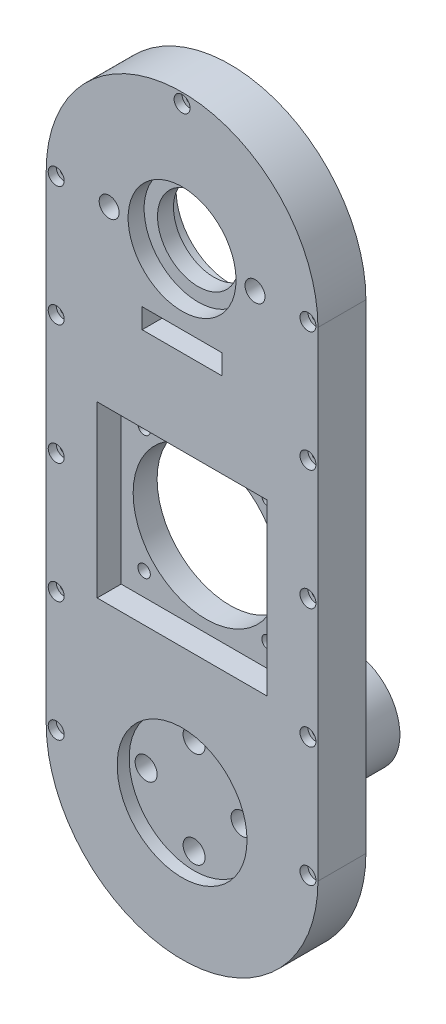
ISO-10303-21;
HEADER;
FILE_DESCRIPTION(('STEP AP214'),'2;1');
FILE_NAME('part.step','',(''),(''),'','','');
FILE_SCHEMA(('AUTOMOTIVE_DESIGN { 1 0 10303 214 1 1 1 1 }'));
ENDSEC;
DATA;
#1=APPLICATION_CONTEXT('core data for automotive mechanical design processes');
#2=APPLICATION_PROTOCOL_DEFINITION('international standard','automotive_design',2000,#1);
#3=PRODUCT_CONTEXT('',#1,'mechanical');
#4=PRODUCT('Part','Part','',(#3));
#5=PRODUCT_RELATED_PRODUCT_CATEGORY('part','',(#4));
#6=PRODUCT_DEFINITION_FORMATION('','',#4);
#7=PRODUCT_DEFINITION_CONTEXT('part definition',#1,'design');
#8=PRODUCT_DEFINITION('design','',#6,#7);
#9=PRODUCT_DEFINITION_SHAPE('','',#8);
#10=(LENGTH_UNIT() NAMED_UNIT(*) SI_UNIT(.MILLI.,.METRE.));
#11=(NAMED_UNIT(*) PLANE_ANGLE_UNIT() SI_UNIT($,.RADIAN.));
#12=(NAMED_UNIT(*) SI_UNIT($,.STERADIAN.) SOLID_ANGLE_UNIT());
#13=UNCERTAINTY_MEASURE_WITH_UNIT(LENGTH_MEASURE(1.E-05),#10,'distance_accuracy_value','');
#14=(GEOMETRIC_REPRESENTATION_CONTEXT(3) GLOBAL_UNCERTAINTY_ASSIGNED_CONTEXT((#13)) GLOBAL_UNIT_ASSIGNED_CONTEXT((#10,
#11,#12)) REPRESENTATION_CONTEXT('',''));
#15=CARTESIAN_POINT('',(0.,0.,0.));
#16=DIRECTION('',(0.,0.,1.));
#17=DIRECTION('',(1.,0.,0.));
#18=AXIS2_PLACEMENT_3D('',#15,#16,#17);
#19=CARTESIAN_POINT('',(0.,60.,-30.001));
#20=DIRECTION('',(0.,0.,1.));
#21=DIRECTION('',(1.,0.,0.));
#22=AXIS2_PLACEMENT_3D('',#19,#20,#21);
#23=CYLINDRICAL_SURFACE('',#22,10.15);
#24=CARTESIAN_POINT('',(0.,60.,8.));
#25=DIRECTION('',(0.,0.,1.));
#26=DIRECTION('',(1.,0.,0.));
#27=AXIS2_PLACEMENT_3D('',#24,#25,#26);
#28=CIRCLE('',#27,10.15);
#29=CARTESIAN_POINT('',(10.15,60.,8.));
#30=VERTEX_POINT('',#29);
#31=EDGE_CURVE('E323',#30,#30,#28,.F.);
#32=ORIENTED_EDGE('',*,*,#31,.F.);
#33=EDGE_LOOP('',(#32));
#34=FACE_BOUND('',#33,.T.);
#35=CARTESIAN_POINT('',(0.,60.,4.));
#36=DIRECTION('',(0.,0.,-1.));
#37=DIRECTION('',(-1.,0.,0.));
#38=AXIS2_PLACEMENT_3D('',#35,#36,#37);
#39=CIRCLE('',#38,10.15);
#40=CARTESIAN_POINT('',(-10.15,60.,4.));
#41=VERTEX_POINT('',#40);
#42=EDGE_CURVE('E317',#41,#41,#39,.F.);
#43=ORIENTED_EDGE('',*,*,#42,.F.);
#44=EDGE_LOOP('',(#43));
#45=FACE_BOUND('',#44,.T.);
#46=ADVANCED_FACE('F35',(#34,#45),#23,.F.);
#47=CARTESIAN_POINT('',(-15.5,10.5,-30.001));
#48=DIRECTION('',(0.,0.,1.));
#49=DIRECTION('',(1.,0.,0.));
#50=AXIS2_PLACEMENT_3D('',#47,#48,#49);
#51=CYLINDRICAL_SURFACE('',#50,1.55);
#52=CARTESIAN_POINT('',(-15.5,10.5,6.));
#53=DIRECTION('',(0.,0.,-1.));
#54=DIRECTION('',(-1.,0.,0.));
#55=AXIS2_PLACEMENT_3D('',#52,#53,#54);
#56=CIRCLE('',#55,1.55);
#57=CARTESIAN_POINT('',(-17.05,10.5,6.));
#58=VERTEX_POINT('',#57);
#59=EDGE_CURVE('E203',#58,#58,#56,.F.);
#60=ORIENTED_EDGE('',*,*,#59,.T.);
#61=EDGE_LOOP('',(#60));
#62=FACE_BOUND('',#61,.T.);
#63=CARTESIAN_POINT('',(-15.5,10.5,3.));
#64=DIRECTION('',(0.,0.,-1.));
#65=DIRECTION('',(-1.,0.,0.));
#66=AXIS2_PLACEMENT_3D('',#63,#64,#65);
#67=CIRCLE('',#66,1.55);
#68=CARTESIAN_POINT('',(-17.05,10.5,3.));
#69=VERTEX_POINT('',#68);
#70=EDGE_CURVE('E356',#69,#69,#67,.F.);
#71=ORIENTED_EDGE('',*,*,#70,.F.);
#72=EDGE_LOOP('',(#71));
#73=FACE_BOUND('',#72,.T.);
#74=ADVANCED_FACE('F479',(#62,#73),#51,.F.);
#75=CARTESIAN_POINT('',(-15.5,-20.5,-30.001));
#76=DIRECTION('',(0.,0.,1.));
#77=DIRECTION('',(1.,0.,0.));
#78=AXIS2_PLACEMENT_3D('',#75,#76,#77);
#79=CYLINDRICAL_SURFACE('',#78,1.54999999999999);
#80=CARTESIAN_POINT('',(-15.5,-20.5,6.));
#81=DIRECTION('',(0.,0.,-1.));
#82=DIRECTION('',(-1.,0.,0.));
#83=AXIS2_PLACEMENT_3D('',#80,#81,#82);
#84=CIRCLE('',#83,1.54999999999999);
#85=CARTESIAN_POINT('',(-17.05,-20.5,6.));
#86=VERTEX_POINT('',#85);
#87=EDGE_CURVE('E200',#86,#86,#84,.F.);
#88=ORIENTED_EDGE('',*,*,#87,.T.);
#89=EDGE_LOOP('',(#88));
#90=FACE_BOUND('',#89,.T.);
#91=CARTESIAN_POINT('',(-15.5,-20.5,3.));
#92=DIRECTION('',(0.,0.,-1.));
#93=DIRECTION('',(-1.,0.,0.));
#94=AXIS2_PLACEMENT_3D('',#91,#92,#93);
#95=CIRCLE('',#94,1.54999999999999);
#96=CARTESIAN_POINT('',(-17.05,-20.5,3.));
#97=VERTEX_POINT('',#96);
#98=EDGE_CURVE('E423',#97,#97,#95,.F.);
#99=ORIENTED_EDGE('',*,*,#98,.F.);
#100=EDGE_LOOP('',(#99));
#101=FACE_BOUND('',#100,.T.);
#102=ADVANCED_FACE('F485',(#90,#101),#79,.F.);
#103=CARTESIAN_POINT('',(15.5,-20.5,-30.001));
#104=DIRECTION('',(0.,0.,1.));
#105=DIRECTION('',(1.,0.,0.));
#106=AXIS2_PLACEMENT_3D('',#103,#104,#105);
#107=CYLINDRICAL_SURFACE('',#106,1.55);
#108=CARTESIAN_POINT('',(15.5,-20.5,6.));
#109=DIRECTION('',(0.,0.,-1.));
#110=DIRECTION('',(-1.,0.,0.));
#111=AXIS2_PLACEMENT_3D('',#108,#109,#110);
#112=CIRCLE('',#111,1.55);
#113=CARTESIAN_POINT('',(13.95,-20.5,6.));
#114=VERTEX_POINT('',#113);
#115=EDGE_CURVE('E197',#114,#114,#112,.F.);
#116=ORIENTED_EDGE('',*,*,#115,.T.);
#117=EDGE_LOOP('',(#116));
#118=FACE_BOUND('',#117,.T.);
#119=CARTESIAN_POINT('',(15.5,-20.5,3.));
#120=DIRECTION('',(0.,0.,-1.));
#121=DIRECTION('',(-1.,0.,0.));
#122=AXIS2_PLACEMENT_3D('',#119,#120,#121);
#123=CIRCLE('',#122,1.55);
#124=CARTESIAN_POINT('',(13.95,-20.5,3.));
#125=VERTEX_POINT('',#124);
#126=EDGE_CURVE('E420',#125,#125,#123,.F.);
#127=ORIENTED_EDGE('',*,*,#126,.F.);
#128=EDGE_LOOP('',(#127));
#129=FACE_BOUND('',#128,.T.);
#130=ADVANCED_FACE('F528',(#118,#129),#107,.F.);
#131=CARTESIAN_POINT('',(15.5,10.5,-30.001));
#132=DIRECTION('',(0.,0.,1.));
#133=DIRECTION('',(1.,0.,0.));
#134=AXIS2_PLACEMENT_3D('',#131,#132,#133);
#135=CYLINDRICAL_SURFACE('',#134,1.55);
#136=CARTESIAN_POINT('',(15.5,10.5,6.));
#137=DIRECTION('',(0.,0.,-1.));
#138=DIRECTION('',(-1.,0.,0.));
#139=AXIS2_PLACEMENT_3D('',#136,#137,#138);
#140=CIRCLE('',#139,1.55);
#141=CARTESIAN_POINT('',(13.95,10.5,6.));
#142=VERTEX_POINT('',#141);
#143=EDGE_CURVE('E194',#142,#142,#140,.F.);
#144=ORIENTED_EDGE('',*,*,#143,.T.);
#145=EDGE_LOOP('',(#144));
#146=FACE_BOUND('',#145,.T.);
#147=CARTESIAN_POINT('',(15.5,10.5,3.));
#148=DIRECTION('',(0.,0.,-1.));
#149=DIRECTION('',(-1.,0.,0.));
#150=AXIS2_PLACEMENT_3D('',#147,#148,#149);
#151=CIRCLE('',#150,1.55);
#152=CARTESIAN_POINT('',(13.95,10.5,3.));
#153=VERTEX_POINT('',#152);
#154=EDGE_CURVE('E349',#153,#153,#151,.F.);
#155=ORIENTED_EDGE('',*,*,#154,.F.);
#156=EDGE_LOOP('',(#155));
#157=FACE_BOUND('',#156,.T.);
#158=ADVANCED_FACE('F531',(#146,#157),#135,.F.);
#159=CARTESIAN_POINT('',(0.,60.,12.));
#160=DIRECTION('',(0.,0.,-1.));
#161=DIRECTION('',(-1.,0.,0.));
#162=AXIS2_PLACEMENT_3D('',#159,#160,#161);
#163=CYLINDRICAL_SURFACE('',#162,34.);
#164=CARTESIAN_POINT('',(0.,60.,0.));
#165=DIRECTION('',(0.,0.,1.));
#166=DIRECTION('',(-1.,0.,0.));
#167=AXIS2_PLACEMENT_3D('',#164,#165,#166);
#168=CIRCLE('',#167,34.);
#169=CARTESIAN_POINT('',(34.,60.,0.));
#170=VERTEX_POINT('',#169);
#171=CARTESIAN_POINT('',(-34.,60.,0.));
#172=VERTEX_POINT('',#171);
#173=EDGE_CURVE('E390',#170,#172,#168,.T.);
#174=ORIENTED_EDGE('',*,*,#173,.T.);
#175=DIRECTION('',(0.,0.,-1.));
#176=VECTOR('',#175,1.);
#177=CARTESIAN_POINT('',(-34.,60.,12.));
#178=LINE('',#177,#176);
#179=CARTESIAN_POINT('',(-34.,60.,12.));
#180=VERTEX_POINT('',#179);
#181=EDGE_CURVE('E11',#180,#172,#178,.T.);
#182=ORIENTED_EDGE('',*,*,#181,.F.);
#183=CARTESIAN_POINT('',(0.,60.,12.));
#184=DIRECTION('',(0.,0.,1.));
#185=DIRECTION('',(-1.,0.,0.));
#186=AXIS2_PLACEMENT_3D('',#183,#184,#185);
#187=CIRCLE('',#186,34.);
#188=CARTESIAN_POINT('',(34.,60.,12.));
#189=VERTEX_POINT('',#188);
#190=EDGE_CURVE('E393',#189,#180,#187,.T.);
#191=ORIENTED_EDGE('',*,*,#190,.F.);
#192=DIRECTION('',(0.,0.,-1.));
#193=VECTOR('',#192,1.);
#194=CARTESIAN_POINT('',(34.,60.,12.));
#195=LINE('',#194,#193);
#196=EDGE_CURVE('E403',#189,#170,#195,.T.);
#197=ORIENTED_EDGE('',*,*,#196,.T.);
#198=EDGE_LOOP('',(#174,#182,#191,#197));
#199=FACE_BOUND('',#198,.T.);
#200=ADVANCED_FACE('F37',(#199),#163,.T.);
#201=CARTESIAN_POINT('',(-34.,-60.,12.));
#202=DIRECTION('',(1.,0.,0.));
#203=DIRECTION('',(0.,0.,-1.));
#204=AXIS2_PLACEMENT_3D('',#201,#202,#203);
#205=PLANE('',#204);
#206=DIRECTION('',(0.,-1.,0.));
#207=VECTOR('',#206,1.);
#208=CARTESIAN_POINT('',(-34.,-60.,0.));
#209=LINE('',#208,#207);
#210=CARTESIAN_POINT('',(-34.,-60.,0.));
#211=VERTEX_POINT('',#210);
#212=EDGE_CURVE('E406',#172,#211,#209,.T.);
#213=ORIENTED_EDGE('',*,*,#212,.T.);
#214=DIRECTION('',(0.,0.,-1.));
#215=VECTOR('',#214,1.);
#216=CARTESIAN_POINT('',(-34.,-60.,12.));
#217=LINE('',#216,#215);
#218=CARTESIAN_POINT('',(-34.,-60.,12.));
#219=VERTEX_POINT('',#218);
#220=EDGE_CURVE('E44',#219,#211,#217,.T.);
#221=ORIENTED_EDGE('',*,*,#220,.F.);
#222=DIRECTION('',(0.,-1.,0.));
#223=VECTOR('',#222,1.);
#224=CARTESIAN_POINT('',(-34.,-60.,12.));
#225=LINE('',#224,#223);
#226=EDGE_CURVE('E396',#180,#219,#225,.T.);
#227=ORIENTED_EDGE('',*,*,#226,.F.);
#228=ORIENTED_EDGE('',*,*,#181,.T.);
#229=EDGE_LOOP('',(#213,#221,#227,#228));
#230=FACE_BOUND('',#229,.T.);
#231=ADVANCED_FACE('F602',(#230),#205,.F.);
#232=CARTESIAN_POINT('',(0.,-60.,12.));
#233=DIRECTION('',(0.,0.,-1.));
#234=DIRECTION('',(-1.,0.,0.));
#235=AXIS2_PLACEMENT_3D('',#232,#233,#234);
#236=CYLINDRICAL_SURFACE('',#235,34.);
#237=CARTESIAN_POINT('',(0.,-60.,0.));
#238=DIRECTION('',(0.,0.,1.));
#239=DIRECTION('',(-1.,0.,0.));
#240=AXIS2_PLACEMENT_3D('',#237,#238,#239);
#241=CIRCLE('',#240,34.);
#242=CARTESIAN_POINT('',(34.,-60.,0.));
#243=VERTEX_POINT('',#242);
#244=EDGE_CURVE('E408',#211,#243,#241,.T.);
#245=ORIENTED_EDGE('',*,*,#244,.T.);
#246=DIRECTION('',(0.,0.,-1.));
#247=VECTOR('',#246,1.);
#248=CARTESIAN_POINT('',(34.,-60.,12.));
#249=LINE('',#248,#247);
#250=CARTESIAN_POINT('',(34.,-60.,12.));
#251=VERTEX_POINT('',#250);
#252=EDGE_CURVE('E413',#251,#243,#249,.T.);
#253=ORIENTED_EDGE('',*,*,#252,.F.);
#254=CARTESIAN_POINT('',(0.,-60.,12.));
#255=DIRECTION('',(0.,0.,1.));
#256=DIRECTION('',(-1.,0.,0.));
#257=AXIS2_PLACEMENT_3D('',#254,#255,#256);
#258=CIRCLE('',#257,34.);
#259=EDGE_CURVE('E399',#219,#251,#258,.T.);
#260=ORIENTED_EDGE('',*,*,#259,.F.);
#261=ORIENTED_EDGE('',*,*,#220,.T.);
#262=EDGE_LOOP('',(#245,#253,#260,#261));
#263=FACE_BOUND('',#262,.T.);
#264=ADVANCED_FACE('F599',(#263),#236,.T.);
#265=CARTESIAN_POINT('',(34.,-60.,12.));
#266=DIRECTION('',(-1.,0.,0.));
#267=DIRECTION('',(0.,0.,1.));
#268=AXIS2_PLACEMENT_3D('',#265,#266,#267);
#269=PLANE('',#268);
#270=DIRECTION('',(0.,1.,0.));
#271=VECTOR('',#270,1.);
#272=CARTESIAN_POINT('',(34.,-60.,0.));
#273=LINE('',#272,#271);
#274=EDGE_CURVE('E397',#243,#170,#273,.T.);
#275=ORIENTED_EDGE('',*,*,#274,.T.);
#276=ORIENTED_EDGE('',*,*,#196,.F.);
#277=DIRECTION('',(0.,1.,0.));
#278=VECTOR('',#277,1.);
#279=CARTESIAN_POINT('',(34.,-60.,12.));
#280=LINE('',#279,#278);
#281=EDGE_CURVE('E401',#251,#189,#280,.T.);
#282=ORIENTED_EDGE('',*,*,#281,.F.);
#283=ORIENTED_EDGE('',*,*,#252,.T.);
#284=EDGE_LOOP('',(#275,#276,#282,#283));
#285=FACE_BOUND('',#284,.T.);
#286=ADVANCED_FACE('F593',(#285),#269,.F.);
#287=CARTESIAN_POINT('',(0.,60.,12.));
#288=DIRECTION('',(0.,0.,-1.));
#289=DIRECTION('',(-1.,0.,0.));
#290=AXIS2_PLACEMENT_3D('',#287,#288,#289);
#291=PLANE('',#290);
#292=DIRECTION('',(1.,0.,0.));
#293=VECTOR('',#292,1.);
#294=CARTESIAN_POINT('',(10.,37.5,12.));
#295=LINE('',#294,#293);
#296=CARTESIAN_POINT('',(-10.,37.5,12.));
#297=VERTEX_POINT('',#296);
#298=CARTESIAN_POINT('',(10.,37.5,12.));
#299=VERTEX_POINT('',#298);
#300=EDGE_CURVE('E146',#297,#299,#295,.T.);
#301=ORIENTED_EDGE('',*,*,#300,.F.);
#302=DIRECTION('',(0.,-1.,0.));
#303=VECTOR('',#302,1.);
#304=CARTESIAN_POINT('',(-10.,37.5,12.));
#305=LINE('',#304,#303);
#306=CARTESIAN_POINT('',(-10.,42.5,12.));
#307=VERTEX_POINT('',#306);
#308=EDGE_CURVE('E128',#307,#297,#305,.T.);
#309=ORIENTED_EDGE('',*,*,#308,.F.);
#310=DIRECTION('',(-1.,0.,0.));
#311=VECTOR('',#310,1.);
#312=CARTESIAN_POINT('',(10.,42.5,12.));
#313=LINE('',#312,#311);
#314=CARTESIAN_POINT('',(10.,42.5,12.));
#315=VERTEX_POINT('',#314);
#316=EDGE_CURVE('E137',#315,#307,#313,.T.);
#317=ORIENTED_EDGE('',*,*,#316,.F.);
#318=DIRECTION('',(0.,1.,0.));
#319=VECTOR('',#318,1.);
#320=CARTESIAN_POINT('',(10.,37.5,12.));
#321=LINE('',#320,#319);
#322=EDGE_CURVE('E52',#299,#315,#321,.T.);
#323=ORIENTED_EDGE('',*,*,#322,.F.);
#324=EDGE_LOOP('',(#301,#309,#317,#323));
#325=FACE_BOUND('',#324,.T.);
#326=DIRECTION('',(-1.,0.,0.));
#327=VECTOR('',#326,1.);
#328=CARTESIAN_POINT('',(-21.25,16.25,12.));
#329=LINE('',#328,#327);
#330=CARTESIAN_POINT('',(21.25,16.25,12.));
#331=VERTEX_POINT('',#330);
#332=CARTESIAN_POINT('',(-21.25,16.25,12.));
#333=VERTEX_POINT('',#332);
#334=EDGE_CURVE('E178',#331,#333,#329,.T.);
#335=ORIENTED_EDGE('',*,*,#334,.F.);
#336=DIRECTION('',(0.,1.,0.));
#337=VECTOR('',#336,1.);
#338=CARTESIAN_POINT('',(21.25,-26.25,12.));
#339=LINE('',#338,#337);
#340=CARTESIAN_POINT('',(21.25,-26.25,12.));
#341=VERTEX_POINT('',#340);
#342=EDGE_CURVE('E140',#341,#331,#339,.T.);
#343=ORIENTED_EDGE('',*,*,#342,.F.);
#344=DIRECTION('',(1.,0.,0.));
#345=VECTOR('',#344,1.);
#346=CARTESIAN_POINT('',(-21.25,-26.25,12.));
#347=LINE('',#346,#345);
#348=CARTESIAN_POINT('',(-21.25,-26.25,12.));
#349=VERTEX_POINT('',#348);
#350=EDGE_CURVE('E167',#349,#341,#347,.T.);
#351=ORIENTED_EDGE('',*,*,#350,.F.);
#352=DIRECTION('',(0.,-1.,0.));
#353=VECTOR('',#352,1.);
#354=CARTESIAN_POINT('',(-21.25,-26.25,12.));
#355=LINE('',#354,#353);
#356=EDGE_CURVE('E181',#333,#349,#355,.T.);
#357=ORIENTED_EDGE('',*,*,#356,.F.);
#358=EDGE_LOOP('',(#335,#343,#351,#357));
#359=FACE_BOUND('',#358,.T.);
#360=CARTESIAN_POINT('',(-18.25,60.,12.));
#361=DIRECTION('',(0.,0.,1.));
#362=DIRECTION('',(1.,0.,0.));
#363=AXIS2_PLACEMENT_3D('',#360,#361,#362);
#364=CIRCLE('',#363,2.5);
#365=CARTESIAN_POINT('',(-15.75,60.,12.));
#366=VERTEX_POINT('',#365);
#367=EDGE_CURVE('E207',#366,#366,#364,.T.);
#368=ORIENTED_EDGE('',*,*,#367,.F.);
#369=EDGE_LOOP('',(#368));
#370=FACE_BOUND('',#369,.T.);
#371=CARTESIAN_POINT('',(18.25,60.,12.));
#372=DIRECTION('',(0.,0.,1.));
#373=DIRECTION('',(1.,0.,0.));
#374=AXIS2_PLACEMENT_3D('',#371,#372,#373);
#375=CIRCLE('',#374,2.5);
#376=CARTESIAN_POINT('',(20.75,60.,12.));
#377=VERTEX_POINT('',#376);
#378=EDGE_CURVE('E214',#377,#377,#375,.T.);
#379=ORIENTED_EDGE('',*,*,#378,.F.);
#380=EDGE_LOOP('',(#379));
#381=FACE_BOUND('',#380,.T.);
#382=CARTESIAN_POINT('',(0.,91.5,12.));
#383=DIRECTION('',(0.,0.,-1.));
#384=DIRECTION('',(-1.,0.,0.));
#385=AXIS2_PLACEMENT_3D('',#382,#383,#384);
#386=CIRCLE('',#385,2.00000000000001);
#387=CARTESIAN_POINT('',(-2.00000000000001,91.5,12.));
#388=VERTEX_POINT('',#387);
#389=EDGE_CURVE('E223',#388,#388,#386,.T.);
#390=ORIENTED_EDGE('',*,*,#389,.T.);
#391=EDGE_LOOP('',(#390));
#392=FACE_BOUND('',#391,.T.);
#393=CARTESIAN_POINT('',(-31.4999999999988,-60.,12.));
#394=DIRECTION('',(0.,0.,-1.));
#395=DIRECTION('',(-1.,0.,0.));
#396=AXIS2_PLACEMENT_3D('',#393,#394,#395);
#397=CIRCLE('',#396,2.);
#398=CARTESIAN_POINT('',(-33.4999999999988,-60.,12.));
#399=VERTEX_POINT('',#398);
#400=EDGE_CURVE('E210',#399,#399,#397,.T.);
#401=ORIENTED_EDGE('',*,*,#400,.T.);
#402=EDGE_LOOP('',(#401));
#403=FACE_BOUND('',#402,.T.);
#404=CARTESIAN_POINT('',(-31.4999999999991,-30.,12.));
#405=DIRECTION('',(0.,0.,-1.));
#406=DIRECTION('',(-1.,0.,0.));
#407=AXIS2_PLACEMENT_3D('',#404,#405,#406);
#408=CIRCLE('',#407,2.);
#409=CARTESIAN_POINT('',(-33.4999999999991,-30.,12.));
#410=VERTEX_POINT('',#409);
#411=EDGE_CURVE('E231',#410,#410,#408,.T.);
#412=ORIENTED_EDGE('',*,*,#411,.T.);
#413=EDGE_LOOP('',(#412));
#414=FACE_BOUND('',#413,.T.);
#415=CARTESIAN_POINT('',(-31.5,60.,12.));
#416=DIRECTION('',(0.,0.,-1.));
#417=DIRECTION('',(-1.,0.,0.));
#418=AXIS2_PLACEMENT_3D('',#415,#416,#417);
#419=CIRCLE('',#418,2.);
#420=CARTESIAN_POINT('',(-33.5,60.,12.));
#421=VERTEX_POINT('',#420);
#422=EDGE_CURVE('E265',#421,#421,#419,.T.);
#423=ORIENTED_EDGE('',*,*,#422,.T.);
#424=EDGE_LOOP('',(#423));
#425=FACE_BOUND('',#424,.T.);
#426=CARTESIAN_POINT('',(31.5,60.,12.));
#427=DIRECTION('',(0.,0.,-1.));
#428=DIRECTION('',(-1.,0.,0.));
#429=AXIS2_PLACEMENT_3D('',#426,#427,#428);
#430=CIRCLE('',#429,2.00000000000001);
#431=CARTESIAN_POINT('',(29.5,60.,12.));
#432=VERTEX_POINT('',#431);
#433=EDGE_CURVE('E271',#432,#432,#430,.T.);
#434=ORIENTED_EDGE('',*,*,#433,.T.);
#435=EDGE_LOOP('',(#434));
#436=FACE_BOUND('',#435,.T.);
#437=CARTESIAN_POINT('',(31.5000000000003,30.,12.));
#438=DIRECTION('',(0.,0.,-1.));
#439=DIRECTION('',(-1.,0.,0.));
#440=AXIS2_PLACEMENT_3D('',#437,#438,#439);
#441=CIRCLE('',#440,2.);
#442=CARTESIAN_POINT('',(29.5000000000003,30.,12.));
#443=VERTEX_POINT('',#442);
#444=EDGE_CURVE('E277',#443,#443,#441,.T.);
#445=ORIENTED_EDGE('',*,*,#444,.T.);
#446=EDGE_LOOP('',(#445));
#447=FACE_BOUND('',#446,.T.);
#448=CARTESIAN_POINT('',(31.5000000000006,0.,12.));
#449=DIRECTION('',(0.,0.,-1.));
#450=DIRECTION('',(-1.,0.,0.));
#451=AXIS2_PLACEMENT_3D('',#448,#449,#450);
#452=CIRCLE('',#451,2.);
#453=CARTESIAN_POINT('',(29.5000000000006,0.,12.));
#454=VERTEX_POINT('',#453);
#455=EDGE_CURVE('E242',#454,#454,#452,.T.);
#456=ORIENTED_EDGE('',*,*,#455,.T.);
#457=EDGE_LOOP('',(#456));
#458=FACE_BOUND('',#457,.T.);
#459=CARTESIAN_POINT('',(31.5000000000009,-30.,12.));
#460=DIRECTION('',(0.,0.,-1.));
#461=DIRECTION('',(-1.,0.,0.));
#462=AXIS2_PLACEMENT_3D('',#459,#460,#461);
#463=CIRCLE('',#462,2.);
#464=CARTESIAN_POINT('',(29.5000000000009,-30.,12.));
#465=VERTEX_POINT('',#464);
#466=EDGE_CURVE('E243',#465,#465,#463,.T.);
#467=ORIENTED_EDGE('',*,*,#466,.T.);
#468=EDGE_LOOP('',(#467));
#469=FACE_BOUND('',#468,.T.);
#470=CARTESIAN_POINT('',(31.5000000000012,-60.,12.));
#471=DIRECTION('',(0.,0.,-1.));
#472=DIRECTION('',(-1.,0.,0.));
#473=AXIS2_PLACEMENT_3D('',#470,#471,#472);
#474=CIRCLE('',#473,2.);
#475=CARTESIAN_POINT('',(29.5000000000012,-60.,12.));
#476=VERTEX_POINT('',#475);
#477=EDGE_CURVE('E249',#476,#476,#474,.T.);
#478=ORIENTED_EDGE('',*,*,#477,.T.);
#479=EDGE_LOOP('',(#478));
#480=FACE_BOUND('',#479,.T.);
#481=CARTESIAN_POINT('',(-31.4999999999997,30.,12.));
#482=DIRECTION('',(0.,0.,-1.));
#483=DIRECTION('',(-1.,0.,0.));
#484=AXIS2_PLACEMENT_3D('',#481,#482,#483);
#485=CIRCLE('',#484,2.);
#486=CARTESIAN_POINT('',(-33.4999999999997,30.,12.));
#487=VERTEX_POINT('',#486);
#488=EDGE_CURVE('E255',#487,#487,#485,.T.);
#489=ORIENTED_EDGE('',*,*,#488,.T.);
#490=EDGE_LOOP('',(#489));
#491=FACE_BOUND('',#490,.T.);
#492=CARTESIAN_POINT('',(-31.4999999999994,0.,12.));
#493=DIRECTION('',(0.,0.,-1.));
#494=DIRECTION('',(-1.,0.,0.));
#495=AXIS2_PLACEMENT_3D('',#492,#493,#494);
#496=CIRCLE('',#495,2.);
#497=CARTESIAN_POINT('',(-33.4999999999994,0.,12.));
#498=VERTEX_POINT('',#497);
#499=EDGE_CURVE('E230',#498,#498,#496,.T.);
#500=ORIENTED_EDGE('',*,*,#499,.T.);
#501=EDGE_LOOP('',(#500));
#502=FACE_BOUND('',#501,.T.);
#503=CARTESIAN_POINT('',(0.,60.,12.));
#504=DIRECTION('',(0.,0.,1.));
#505=DIRECTION('',(1.,0.,0.));
#506=AXIS2_PLACEMENT_3D('',#503,#504,#505);
#507=CIRCLE('',#506,13.5);
#508=CARTESIAN_POINT('',(13.5,60.,12.));
#509=VERTEX_POINT('',#508);
#510=EDGE_CURVE('E324',#509,#509,#507,.T.);
#511=ORIENTED_EDGE('',*,*,#510,.F.);
#512=EDGE_LOOP('',(#511));
#513=FACE_BOUND('',#512,.T.);
#514=CARTESIAN_POINT('',(0.,-60.,12.));
#515=DIRECTION('',(0.,0.,1.));
#516=DIRECTION('',(1.,0.,0.));
#517=AXIS2_PLACEMENT_3D('',#514,#515,#516);
#518=CIRCLE('',#517,16.25);
#519=CARTESIAN_POINT('',(16.25,-60.,12.));
#520=VERTEX_POINT('',#519);
#521=EDGE_CURVE('E366',#520,#520,#518,.T.);
#522=ORIENTED_EDGE('',*,*,#521,.F.);
#523=EDGE_LOOP('',(#522));
#524=FACE_BOUND('',#523,.T.);
#525=ORIENTED_EDGE('',*,*,#190,.T.);
#526=ORIENTED_EDGE('',*,*,#226,.T.);
#527=ORIENTED_EDGE('',*,*,#259,.T.);
#528=ORIENTED_EDGE('',*,*,#281,.T.);
#529=EDGE_LOOP('',(#525,#526,#527,#528));
#530=FACE_BOUND('',#529,.T.);
#531=ADVANCED_FACE('F143',(#325,#359,#370,#381,#392,#403,#414,#425,#436,#447,#458,#469,#480,
#491,#502,#513,#524,#530),#291,.F.);
#532=CARTESIAN_POINT('',(0.,60.,0.));
#533=DIRECTION('',(0.,0.,-1.));
#534=DIRECTION('',(-1.,0.,0.));
#535=AXIS2_PLACEMENT_3D('',#532,#533,#534);
#536=PLANE('',#535);
#537=DIRECTION('',(0.,1.,0.));
#538=VECTOR('',#537,1.);
#539=CARTESIAN_POINT('',(-10.,37.5,0.));
#540=LINE('',#539,#538);
#541=CARTESIAN_POINT('',(-10.,37.5,0.));
#542=VERTEX_POINT('',#541);
#543=CARTESIAN_POINT('',(-10.,42.5,0.));
#544=VERTEX_POINT('',#543);
#545=EDGE_CURVE('E60',#542,#544,#540,.T.);
#546=ORIENTED_EDGE('',*,*,#545,.F.);
#547=DIRECTION('',(-1.,0.,0.));
#548=VECTOR('',#547,1.);
#549=CARTESIAN_POINT('',(10.,37.5,0.));
#550=LINE('',#549,#548);
#551=CARTESIAN_POINT('',(10.,37.5,0.));
#552=VERTEX_POINT('',#551);
#553=EDGE_CURVE('E134',#552,#542,#550,.T.);
#554=ORIENTED_EDGE('',*,*,#553,.F.);
#555=DIRECTION('',(0.,-1.,0.));
#556=VECTOR('',#555,1.);
#557=CARTESIAN_POINT('',(10.,37.5,0.));
#558=LINE('',#557,#556);
#559=CARTESIAN_POINT('',(10.,42.5,0.));
#560=VERTEX_POINT('',#559);
#561=EDGE_CURVE('E154',#560,#552,#558,.T.);
#562=ORIENTED_EDGE('',*,*,#561,.F.);
#563=DIRECTION('',(1.,0.,0.));
#564=VECTOR('',#563,1.);
#565=CARTESIAN_POINT('',(10.,42.5,0.));
#566=LINE('',#565,#564);
#567=EDGE_CURVE('E148',#544,#560,#566,.T.);
#568=ORIENTED_EDGE('',*,*,#567,.F.);
#569=EDGE_LOOP('',(#546,#554,#562,#568));
#570=FACE_BOUND('',#569,.T.);
#571=CARTESIAN_POINT('',(-18.25,60.,0.));
#572=DIRECTION('',(0.,0.,-1.));
#573=DIRECTION('',(-1.,0.,0.));
#574=AXIS2_PLACEMENT_3D('',#571,#572,#573);
#575=CIRCLE('',#574,2.5);
#576=CARTESIAN_POINT('',(-20.75,60.,0.));
#577=VERTEX_POINT('',#576);
#578=EDGE_CURVE('E211',#577,#577,#575,.F.);
#579=ORIENTED_EDGE('',*,*,#578,.T.);
#580=EDGE_LOOP('',(#579));
#581=FACE_BOUND('',#580,.T.);
#582=CARTESIAN_POINT('',(18.25,60.,0.));
#583=DIRECTION('',(0.,0.,-1.));
#584=DIRECTION('',(-1.,0.,0.));
#585=AXIS2_PLACEMENT_3D('',#582,#583,#584);
#586=CIRCLE('',#585,2.5);
#587=CARTESIAN_POINT('',(15.75,60.,0.));
#588=VERTEX_POINT('',#587);
#589=EDGE_CURVE('E206',#588,#588,#586,.F.);
#590=ORIENTED_EDGE('',*,*,#589,.T.);
#591=EDGE_LOOP('',(#590));
#592=FACE_BOUND('',#591,.T.);
#593=CARTESIAN_POINT('',(0.,91.5,0.));
#594=DIRECTION('',(0.,0.,-1.));
#595=DIRECTION('',(-1.,0.,0.));
#596=AXIS2_PLACEMENT_3D('',#593,#594,#595);
#597=CIRCLE('',#596,1.);
#598=CARTESIAN_POINT('',(-1.,91.5,0.));
#599=VERTEX_POINT('',#598);
#600=EDGE_CURVE('E285',#599,#599,#597,.F.);
#601=ORIENTED_EDGE('',*,*,#600,.T.);
#602=EDGE_LOOP('',(#601));
#603=FACE_BOUND('',#602,.T.);
#604=CARTESIAN_POINT('',(31.5000000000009,-30.,0.));
#605=DIRECTION('',(0.,0.,-1.));
#606=DIRECTION('',(-1.,0.,0.));
#607=AXIS2_PLACEMENT_3D('',#604,#605,#606);
#608=CIRCLE('',#607,0.999999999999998);
#609=CARTESIAN_POINT('',(30.5000000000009,-30.,0.));
#610=VERTEX_POINT('',#609);
#611=EDGE_CURVE('E298',#610,#610,#608,.F.);
#612=ORIENTED_EDGE('',*,*,#611,.T.);
#613=EDGE_LOOP('',(#612));
#614=FACE_BOUND('',#613,.T.);
#615=CARTESIAN_POINT('',(-31.4999999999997,30.,0.));
#616=DIRECTION('',(0.,0.,-1.));
#617=DIRECTION('',(-1.,0.,0.));
#618=AXIS2_PLACEMENT_3D('',#615,#616,#617);
#619=CIRCLE('',#618,1.);
#620=CARTESIAN_POINT('',(-32.4999999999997,30.,0.));
#621=VERTEX_POINT('',#620);
#622=EDGE_CURVE('E293',#621,#621,#619,.F.);
#623=ORIENTED_EDGE('',*,*,#622,.T.);
#624=EDGE_LOOP('',(#623));
#625=FACE_BOUND('',#624,.T.);
#626=CARTESIAN_POINT('',(-31.4999999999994,0.,0.));
#627=DIRECTION('',(0.,0.,-1.));
#628=DIRECTION('',(-1.,0.,0.));
#629=AXIS2_PLACEMENT_3D('',#626,#627,#628);
#630=CIRCLE('',#629,1.);
#631=CARTESIAN_POINT('',(-32.4999999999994,0.,0.));
#632=VERTEX_POINT('',#631);
#633=EDGE_CURVE('E290',#632,#632,#630,.F.);
#634=ORIENTED_EDGE('',*,*,#633,.T.);
#635=EDGE_LOOP('',(#634));
#636=FACE_BOUND('',#635,.T.);
#637=CARTESIAN_POINT('',(-31.4999999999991,-30.,0.));
#638=DIRECTION('',(0.,0.,-1.));
#639=DIRECTION('',(-1.,0.,0.));
#640=AXIS2_PLACEMENT_3D('',#637,#638,#639);
#641=CIRCLE('',#640,1.);
#642=CARTESIAN_POINT('',(-32.4999999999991,-30.,0.));
#643=VERTEX_POINT('',#642);
#644=EDGE_CURVE('E294',#643,#643,#641,.F.);
#645=ORIENTED_EDGE('',*,*,#644,.T.);
#646=EDGE_LOOP('',(#645));
#647=FACE_BOUND('',#646,.T.);
#648=CARTESIAN_POINT('',(31.5000000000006,0.,0.));
#649=DIRECTION('',(0.,0.,-1.));
#650=DIRECTION('',(-1.,0.,0.));
#651=AXIS2_PLACEMENT_3D('',#648,#649,#650);
#652=CIRCLE('',#651,0.999999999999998);
#653=CARTESIAN_POINT('',(30.5000000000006,0.,0.));
#654=VERTEX_POINT('',#653);
#655=EDGE_CURVE('E301',#654,#654,#652,.F.);
#656=ORIENTED_EDGE('',*,*,#655,.T.);
#657=EDGE_LOOP('',(#656));
#658=FACE_BOUND('',#657,.T.);
#659=CARTESIAN_POINT('',(31.5000000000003,30.,0.));
#660=DIRECTION('',(0.,0.,-1.));
#661=DIRECTION('',(-1.,0.,0.));
#662=AXIS2_PLACEMENT_3D('',#659,#660,#661);
#663=CIRCLE('',#662,0.999999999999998);
#664=CARTESIAN_POINT('',(30.5000000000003,30.,0.));
#665=VERTEX_POINT('',#664);
#666=EDGE_CURVE('E309',#665,#665,#663,.F.);
#667=ORIENTED_EDGE('',*,*,#666,.T.);
#668=EDGE_LOOP('',(#667));
#669=FACE_BOUND('',#668,.T.);
#670=CARTESIAN_POINT('',(31.5,60.,0.));
#671=DIRECTION('',(0.,0.,-1.));
#672=DIRECTION('',(-1.,0.,0.));
#673=AXIS2_PLACEMENT_3D('',#670,#671,#672);
#674=CIRCLE('',#673,0.999999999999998);
#675=CARTESIAN_POINT('',(30.5,60.,0.));
#676=VERTEX_POINT('',#675);
#677=EDGE_CURVE('E306',#676,#676,#674,.F.);
#678=ORIENTED_EDGE('',*,*,#677,.T.);
#679=EDGE_LOOP('',(#678));
#680=FACE_BOUND('',#679,.T.);
#681=CARTESIAN_POINT('',(-31.5,60.,0.));
#682=DIRECTION('',(0.,0.,-1.));
#683=DIRECTION('',(-1.,0.,0.));
#684=AXIS2_PLACEMENT_3D('',#681,#682,#683);
#685=CIRCLE('',#684,1.);
#686=CARTESIAN_POINT('',(-32.5,60.,0.));
#687=VERTEX_POINT('',#686);
#688=EDGE_CURVE('E289',#687,#687,#685,.F.);
#689=ORIENTED_EDGE('',*,*,#688,.T.);
#690=EDGE_LOOP('',(#689));
#691=FACE_BOUND('',#690,.T.);
#692=CARTESIAN_POINT('',(0.,60.,0.));
#693=DIRECTION('',(0.,0.,1.));
#694=DIRECTION('',(1.,0.,0.));
#695=AXIS2_PLACEMENT_3D('',#692,#693,#694);
#696=CIRCLE('',#695,13.5);
#697=CARTESIAN_POINT('',(13.5,60.,0.));
#698=VERTEX_POINT('',#697);
#699=EDGE_CURVE('E288',#698,#698,#696,.T.);
#700=ORIENTED_EDGE('',*,*,#699,.T.);
#701=EDGE_LOOP('',(#700));
#702=FACE_BOUND('',#701,.T.);
#703=CARTESIAN_POINT('',(15.5,10.5,0.));
#704=DIRECTION('',(0.,0.,-1.));
#705=DIRECTION('',(-1.,0.,0.));
#706=AXIS2_PLACEMENT_3D('',#703,#704,#705);
#707=CIRCLE('',#706,3.);
#708=CARTESIAN_POINT('',(12.5,10.5,0.));
#709=VERTEX_POINT('',#708);
#710=EDGE_CURVE('E343',#709,#709,#707,.T.);
#711=ORIENTED_EDGE('',*,*,#710,.F.);
#712=EDGE_LOOP('',(#711));
#713=FACE_BOUND('',#712,.T.);
#714=CARTESIAN_POINT('',(15.5,-20.5,0.));
#715=DIRECTION('',(0.,0.,-1.));
#716=DIRECTION('',(-1.,0.,0.));
#717=AXIS2_PLACEMENT_3D('',#714,#715,#716);
#718=CIRCLE('',#717,3.);
#719=CARTESIAN_POINT('',(12.5,-20.5,0.));
#720=VERTEX_POINT('',#719);
#721=EDGE_CURVE('E337',#720,#720,#718,.T.);
#722=ORIENTED_EDGE('',*,*,#721,.F.);
#723=EDGE_LOOP('',(#722));
#724=FACE_BOUND('',#723,.T.);
#725=CARTESIAN_POINT('',(-15.5,-20.5,0.));
#726=DIRECTION('',(0.,0.,-1.));
#727=DIRECTION('',(-1.,0.,0.));
#728=AXIS2_PLACEMENT_3D('',#725,#726,#727);
#729=CIRCLE('',#728,3.);
#730=CARTESIAN_POINT('',(-18.5,-20.5,0.));
#731=VERTEX_POINT('',#730);
#732=EDGE_CURVE('E331',#731,#731,#729,.T.);
#733=ORIENTED_EDGE('',*,*,#732,.F.);
#734=EDGE_LOOP('',(#733));
#735=FACE_BOUND('',#734,.T.);
#736=CARTESIAN_POINT('',(-15.5,10.5,0.));
#737=DIRECTION('',(0.,0.,-1.));
#738=DIRECTION('',(-1.,0.,0.));
#739=AXIS2_PLACEMENT_3D('',#736,#737,#738);
#740=CIRCLE('',#739,3.);
#741=CARTESIAN_POINT('',(-18.5,10.5,0.));
#742=VERTEX_POINT('',#741);
#743=EDGE_CURVE('E330',#742,#742,#740,.T.);
#744=ORIENTED_EDGE('',*,*,#743,.F.);
#745=EDGE_LOOP('',(#744));
#746=FACE_BOUND('',#745,.T.);
#747=CARTESIAN_POINT('',(0.,-5.,0.));
#748=DIRECTION('',(0.,0.,-1.));
#749=DIRECTION('',(-1.,0.,0.));
#750=AXIS2_PLACEMENT_3D('',#747,#748,#749);
#751=CIRCLE('',#750,18.25);
#752=CARTESIAN_POINT('',(-18.25,-5.,0.));
#753=VERTEX_POINT('',#752);
#754=EDGE_CURVE('E352',#753,#753,#751,.F.);
#755=ORIENTED_EDGE('',*,*,#754,.T.);
#756=EDGE_LOOP('',(#755));
#757=FACE_BOUND('',#756,.T.);
#758=CARTESIAN_POINT('',(0.,-60.,0.));
#759=DIRECTION('',(0.,0.,-1.));
#760=DIRECTION('',(-1.,0.,0.));
#761=AXIS2_PLACEMENT_3D('',#758,#759,#760);
#762=CIRCLE('',#761,12.5);
#763=CARTESIAN_POINT('',(-12.5,-60.,0.));
#764=VERTEX_POINT('',#763);
#765=EDGE_CURVE('E355',#764,#764,#762,.T.);
#766=ORIENTED_EDGE('',*,*,#765,.F.);
#767=EDGE_LOOP('',(#766));
#768=FACE_BOUND('',#767,.T.);
#769=ORIENTED_EDGE('',*,*,#173,.F.);
#770=ORIENTED_EDGE('',*,*,#274,.F.);
#771=ORIENTED_EDGE('',*,*,#244,.F.);
#772=ORIENTED_EDGE('',*,*,#212,.F.);
#773=EDGE_LOOP('',(#769,#770,#771,#772));
#774=FACE_BOUND('',#773,.T.);
#775=ADVANCED_FACE('F589',(#570,#581,#592,#603,#614,#625,#636,#647,#658,#669,#680,#691,#702,
#713,#724,#735,#746,#757,#768,#774),#536,.T.);
#776=CARTESIAN_POINT('',(0.,-60.,9.));
#777=DIRECTION('',(0.,0.,1.));
#778=DIRECTION('',(1.,0.,0.));
#779=AXIS2_PLACEMENT_3D('',#776,#777,#778);
#780=CYLINDRICAL_SURFACE('',#779,16.25);
#781=CARTESIAN_POINT('',(0.,-60.,9.));
#782=DIRECTION('',(0.,0.,1.));
#783=DIRECTION('',(1.,0.,0.));
#784=AXIS2_PLACEMENT_3D('',#781,#782,#783);
#785=CIRCLE('',#784,16.25);
#786=CARTESIAN_POINT('',(16.25,-60.,9.));
#787=VERTEX_POINT('',#786);
#788=EDGE_CURVE('E387',#787,#787,#785,.T.);
#789=ORIENTED_EDGE('',*,*,#788,.F.);
#790=EDGE_LOOP('',(#789));
#791=FACE_BOUND('',#790,.T.);
#792=ORIENTED_EDGE('',*,*,#521,.T.);
#793=EDGE_LOOP('',(#792));
#794=FACE_BOUND('',#793,.T.);
#795=ADVANCED_FACE('F585',(#791,#794),#780,.F.);
#796=CARTESIAN_POINT('',(0.,-60.,9.));
#797=DIRECTION('',(0.,0.,1.));
#798=DIRECTION('',(1.,0.,0.));
#799=AXIS2_PLACEMENT_3D('',#796,#797,#798);
#800=PLANE('',#799);
#801=CARTESIAN_POINT('',(0.,-48.,9.));
#802=DIRECTION('',(0.,0.,1.));
#803=DIRECTION('',(1.,0.,0.));
#804=AXIS2_PLACEMENT_3D('',#801,#802,#803);
#805=CIRCLE('',#804,2.75);
#806=CARTESIAN_POINT('',(2.75,-48.,9.));
#807=VERTEX_POINT('',#806);
#808=EDGE_CURVE('E367',#807,#807,#805,.T.);
#809=ORIENTED_EDGE('',*,*,#808,.F.);
#810=EDGE_LOOP('',(#809));
#811=FACE_BOUND('',#810,.T.);
#812=CARTESIAN_POINT('',(12.,-60.,9.));
#813=DIRECTION('',(0.,0.,1.));
#814=DIRECTION('',(1.,0.,0.));
#815=AXIS2_PLACEMENT_3D('',#812,#813,#814);
#816=CIRCLE('',#815,2.75);
#817=CARTESIAN_POINT('',(14.75,-60.,9.));
#818=VERTEX_POINT('',#817);
#819=EDGE_CURVE('E373',#818,#818,#816,.T.);
#820=ORIENTED_EDGE('',*,*,#819,.F.);
#821=EDGE_LOOP('',(#820));
#822=FACE_BOUND('',#821,.T.);
#823=CARTESIAN_POINT('',(0.,-72.,9.));
#824=DIRECTION('',(0.,0.,1.));
#825=DIRECTION('',(1.,0.,0.));
#826=AXIS2_PLACEMENT_3D('',#823,#824,#825);
#827=CIRCLE('',#826,2.75);
#828=CARTESIAN_POINT('',(2.75000000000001,-72.,9.));
#829=VERTEX_POINT('',#828);
#830=EDGE_CURVE('E379',#829,#829,#827,.T.);
#831=ORIENTED_EDGE('',*,*,#830,.F.);
#832=EDGE_LOOP('',(#831));
#833=FACE_BOUND('',#832,.T.);
#834=CARTESIAN_POINT('',(-12.,-60.,9.));
#835=DIRECTION('',(0.,0.,1.));
#836=DIRECTION('',(1.,0.,0.));
#837=AXIS2_PLACEMENT_3D('',#834,#835,#836);
#838=CIRCLE('',#837,2.75);
#839=CARTESIAN_POINT('',(-9.24999999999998,-60.,9.));
#840=VERTEX_POINT('',#839);
#841=EDGE_CURVE('E360',#840,#840,#838,.T.);
#842=ORIENTED_EDGE('',*,*,#841,.F.);
#843=EDGE_LOOP('',(#842));
#844=FACE_BOUND('',#843,.T.);
#845=ORIENTED_EDGE('',*,*,#788,.T.);
#846=EDGE_LOOP('',(#845));
#847=FACE_BOUND('',#846,.T.);
#848=ADVANCED_FACE('F581',(#811,#822,#833,#844,#847),#800,.T.);
#849=CARTESIAN_POINT('',(-12.,-60.,4.));
#850=DIRECTION('',(0.,0.,1.));
#851=DIRECTION('',(1.,0.,0.));
#852=AXIS2_PLACEMENT_3D('',#849,#850,#851);
#853=CYLINDRICAL_SURFACE('',#852,2.75);
#854=CARTESIAN_POINT('',(-12.,-60.,4.));
#855=DIRECTION('',(0.,0.,1.));
#856=DIRECTION('',(1.,0.,0.));
#857=AXIS2_PLACEMENT_3D('',#854,#855,#856);
#858=CIRCLE('',#857,2.75);
#859=CARTESIAN_POINT('',(-9.24999999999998,-60.,4.));
#860=VERTEX_POINT('',#859);
#861=EDGE_CURVE('E382',#860,#860,#858,.T.);
#862=ORIENTED_EDGE('',*,*,#861,.F.);
#863=EDGE_LOOP('',(#862));
#864=FACE_BOUND('',#863,.T.);
#865=ORIENTED_EDGE('',*,*,#841,.T.);
#866=EDGE_LOOP('',(#865));
#867=FACE_BOUND('',#866,.T.);
#868=ADVANCED_FACE('F577',(#864,#867),#853,.F.);
#869=CARTESIAN_POINT('',(-12.,-60.,4.));
#870=DIRECTION('',(0.,0.,1.));
#871=DIRECTION('',(1.,0.,0.));
#872=AXIS2_PLACEMENT_3D('',#869,#870,#871);
#873=PLANE('',#872);
#874=ORIENTED_EDGE('',*,*,#861,.T.);
#875=EDGE_LOOP('',(#874));
#876=FACE_BOUND('',#875,.T.);
#877=ADVANCED_FACE('F573',(#876),#873,.T.);
#878=CARTESIAN_POINT('',(0.,-72.,4.));
#879=DIRECTION('',(0.,0.,1.));
#880=DIRECTION('',(1.,0.,0.));
#881=AXIS2_PLACEMENT_3D('',#878,#879,#880);
#882=CYLINDRICAL_SURFACE('',#881,2.75);
#883=CARTESIAN_POINT('',(0.,-72.,4.));
#884=DIRECTION('',(0.,0.,1.));
#885=DIRECTION('',(1.,0.,0.));
#886=AXIS2_PLACEMENT_3D('',#883,#884,#885);
#887=CIRCLE('',#886,2.75);
#888=CARTESIAN_POINT('',(2.75000000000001,-72.,4.));
#889=VERTEX_POINT('',#888);
#890=EDGE_CURVE('E376',#889,#889,#887,.T.);
#891=ORIENTED_EDGE('',*,*,#890,.F.);
#892=EDGE_LOOP('',(#891));
#893=FACE_BOUND('',#892,.T.);
#894=ORIENTED_EDGE('',*,*,#830,.T.);
#895=EDGE_LOOP('',(#894));
#896=FACE_BOUND('',#895,.T.);
#897=ADVANCED_FACE('F569',(#893,#896),#882,.F.);
#898=CARTESIAN_POINT('',(0.,-72.,4.));
#899=DIRECTION('',(0.,0.,1.));
#900=DIRECTION('',(1.,0.,0.));
#901=AXIS2_PLACEMENT_3D('',#898,#899,#900);
#902=PLANE('',#901);
#903=ORIENTED_EDGE('',*,*,#890,.T.);
#904=EDGE_LOOP('',(#903));
#905=FACE_BOUND('',#904,.T.);
#906=ADVANCED_FACE('F565',(#905),#902,.T.);
#907=CARTESIAN_POINT('',(12.,-60.,4.));
#908=DIRECTION('',(0.,0.,1.));
#909=DIRECTION('',(1.,0.,0.));
#910=AXIS2_PLACEMENT_3D('',#907,#908,#909);
#911=CYLINDRICAL_SURFACE('',#910,2.75);
#912=CARTESIAN_POINT('',(12.,-60.,4.));
#913=DIRECTION('',(0.,0.,1.));
#914=DIRECTION('',(1.,0.,0.));
#915=AXIS2_PLACEMENT_3D('',#912,#913,#914);
#916=CIRCLE('',#915,2.75);
#917=CARTESIAN_POINT('',(14.75,-60.,4.));
#918=VERTEX_POINT('',#917);
#919=EDGE_CURVE('E370',#918,#918,#916,.T.);
#920=ORIENTED_EDGE('',*,*,#919,.F.);
#921=EDGE_LOOP('',(#920));
#922=FACE_BOUND('',#921,.T.);
#923=ORIENTED_EDGE('',*,*,#819,.T.);
#924=EDGE_LOOP('',(#923));
#925=FACE_BOUND('',#924,.T.);
#926=ADVANCED_FACE('F561',(#922,#925),#911,.F.);
#927=CARTESIAN_POINT('',(12.,-60.,4.));
#928=DIRECTION('',(0.,0.,1.));
#929=DIRECTION('',(1.,0.,0.));
#930=AXIS2_PLACEMENT_3D('',#927,#928,#929);
#931=PLANE('',#930);
#932=ORIENTED_EDGE('',*,*,#919,.T.);
#933=EDGE_LOOP('',(#932));
#934=FACE_BOUND('',#933,.T.);
#935=ADVANCED_FACE('F557',(#934),#931,.T.);
#936=CARTESIAN_POINT('',(0.,-48.,4.));
#937=DIRECTION('',(0.,0.,1.));
#938=DIRECTION('',(1.,0.,0.));
#939=AXIS2_PLACEMENT_3D('',#936,#937,#938);
#940=CYLINDRICAL_SURFACE('',#939,2.75);
#941=CARTESIAN_POINT('',(0.,-48.,4.));
#942=DIRECTION('',(0.,0.,1.));
#943=DIRECTION('',(1.,0.,0.));
#944=AXIS2_PLACEMENT_3D('',#941,#942,#943);
#945=CIRCLE('',#944,2.75);
#946=CARTESIAN_POINT('',(2.75,-48.,4.));
#947=VERTEX_POINT('',#946);
#948=EDGE_CURVE('E363',#947,#947,#945,.T.);
#949=ORIENTED_EDGE('',*,*,#948,.F.);
#950=EDGE_LOOP('',(#949));
#951=FACE_BOUND('',#950,.T.);
#952=ORIENTED_EDGE('',*,*,#808,.T.);
#953=EDGE_LOOP('',(#952));
#954=FACE_BOUND('',#953,.T.);
#955=ADVANCED_FACE('F553',(#951,#954),#940,.F.);
#956=CARTESIAN_POINT('',(0.,-48.,4.));
#957=DIRECTION('',(0.,0.,1.));
#958=DIRECTION('',(1.,0.,0.));
#959=AXIS2_PLACEMENT_3D('',#956,#957,#958);
#960=PLANE('',#959);
#961=ORIENTED_EDGE('',*,*,#948,.T.);
#962=EDGE_LOOP('',(#961));
#963=FACE_BOUND('',#962,.T.);
#964=ADVANCED_FACE('F549',(#963),#960,.T.);
#965=CARTESIAN_POINT('',(0.,-60.,-30.));
#966=DIRECTION('',(0.,0.,1.));
#967=DIRECTION('',(1.,0.,0.));
#968=AXIS2_PLACEMENT_3D('',#965,#966,#967);
#969=CYLINDRICAL_SURFACE('',#968,12.5);
#970=CARTESIAN_POINT('',(0.,-60.,-30.));
#971=DIRECTION('',(0.,0.,-1.));
#972=DIRECTION('',(-1.,0.,0.));
#973=AXIS2_PLACEMENT_3D('',#970,#971,#972);
#974=CIRCLE('',#973,12.5);
#975=CARTESIAN_POINT('',(-12.5,-60.,-30.));
#976=VERTEX_POINT('',#975);
#977=EDGE_CURVE('E357',#976,#976,#974,.T.);
#978=ORIENTED_EDGE('',*,*,#977,.F.);
#979=EDGE_LOOP('',(#978));
#980=FACE_BOUND('',#979,.T.);
#981=ORIENTED_EDGE('',*,*,#765,.T.);
#982=EDGE_LOOP('',(#981));
#983=FACE_BOUND('',#982,.T.);
#984=ADVANCED_FACE('F545',(#980,#983),#969,.T.);
#985=CARTESIAN_POINT('',(0.,-60.,-30.));
#986=DIRECTION('',(0.,0.,-1.));
#987=DIRECTION('',(-1.,0.,0.));
#988=AXIS2_PLACEMENT_3D('',#985,#986,#987);
#989=PLANE('',#988);
#990=ORIENTED_EDGE('',*,*,#977,.T.);
#991=EDGE_LOOP('',(#990));
#992=FACE_BOUND('',#991,.T.);
#993=ADVANCED_FACE('F540',(#992),#989,.T.);
#994=CARTESIAN_POINT('',(0.,-5.,-30.001));
#995=DIRECTION('',(0.,0.,1.));
#996=DIRECTION('',(1.,0.,0.));
#997=AXIS2_PLACEMENT_3D('',#994,#995,#996);
#998=CYLINDRICAL_SURFACE('',#997,18.25);
#999=CARTESIAN_POINT('',(0.,-5.,6.));
#1000=DIRECTION('',(0.,0.,-1.));
#1001=DIRECTION('',(-1.,0.,0.));
#1002=AXIS2_PLACEMENT_3D('',#999,#1000,#1001);
#1003=CIRCLE('',#1002,18.25);
#1004=CARTESIAN_POINT('',(-18.25,-5.,6.));
#1005=VERTEX_POINT('',#1004);
#1006=EDGE_CURVE('E39',#1005,#1005,#1003,.F.);
#1007=ORIENTED_EDGE('',*,*,#1006,.T.);
#1008=EDGE_LOOP('',(#1007));
#1009=FACE_BOUND('',#1008,.T.);
#1010=ORIENTED_EDGE('',*,*,#754,.F.);
#1011=EDGE_LOOP('',(#1010));
#1012=FACE_BOUND('',#1011,.T.);
#1013=ADVANCED_FACE('F515',(#1009,#1012),#998,.F.);
#1014=CARTESIAN_POINT('',(15.5,10.5,3.));
#1015=DIRECTION('',(0.,0.,-1.));
#1016=DIRECTION('',(-1.,0.,0.));
#1017=AXIS2_PLACEMENT_3D('',#1014,#1015,#1016);
#1018=PLANE('',#1017);
#1019=CARTESIAN_POINT('',(15.5,10.5,3.));
#1020=DIRECTION('',(0.,0.,-1.));
#1021=DIRECTION('',(-1.,0.,0.));
#1022=AXIS2_PLACEMENT_3D('',#1019,#1020,#1021);
#1023=CIRCLE('',#1022,3.);
#1024=CARTESIAN_POINT('',(12.5,10.5,3.));
#1025=VERTEX_POINT('',#1024);
#1026=EDGE_CURVE('E340',#1025,#1025,#1023,.T.);
#1027=ORIENTED_EDGE('',*,*,#1026,.T.);
#1028=EDGE_LOOP('',(#1027));
#1029=FACE_BOUND('',#1028,.T.);
#1030=ORIENTED_EDGE('',*,*,#154,.T.);
#1031=EDGE_LOOP('',(#1030));
#1032=FACE_BOUND('',#1031,.T.);
#1033=ADVANCED_FACE('F512',(#1029,#1032),#1018,.T.);
#1034=CARTESIAN_POINT('',(15.5,10.5,3.));
#1035=DIRECTION('',(0.,0.,-1.));
#1036=DIRECTION('',(-1.,0.,0.));
#1037=AXIS2_PLACEMENT_3D('',#1034,#1035,#1036);
#1038=CYLINDRICAL_SURFACE('',#1037,3.);
#1039=ORIENTED_EDGE('',*,*,#1026,.F.);
#1040=EDGE_LOOP('',(#1039));
#1041=FACE_BOUND('',#1040,.T.);
#1042=ORIENTED_EDGE('',*,*,#710,.T.);
#1043=EDGE_LOOP('',(#1042));
#1044=FACE_BOUND('',#1043,.T.);
#1045=ADVANCED_FACE('F507',(#1041,#1044),#1038,.F.);
#1046=CARTESIAN_POINT('',(15.5,-20.5,3.));
#1047=DIRECTION('',(0.,0.,-1.));
#1048=DIRECTION('',(-1.,0.,0.));
#1049=AXIS2_PLACEMENT_3D('',#1046,#1047,#1048);
#1050=PLANE('',#1049);
#1051=CARTESIAN_POINT('',(15.5,-20.5,3.));
#1052=DIRECTION('',(0.,0.,-1.));
#1053=DIRECTION('',(-1.,0.,0.));
#1054=AXIS2_PLACEMENT_3D('',#1051,#1052,#1053);
#1055=CIRCLE('',#1054,3.);
#1056=CARTESIAN_POINT('',(12.5,-20.5,3.));
#1057=VERTEX_POINT('',#1056);
#1058=EDGE_CURVE('E334',#1057,#1057,#1055,.T.);
#1059=ORIENTED_EDGE('',*,*,#1058,.T.);
#1060=EDGE_LOOP('',(#1059));
#1061=FACE_BOUND('',#1060,.T.);
#1062=ORIENTED_EDGE('',*,*,#126,.T.);
#1063=EDGE_LOOP('',(#1062));
#1064=FACE_BOUND('',#1063,.T.);
#1065=ADVANCED_FACE('F504',(#1061,#1064),#1050,.T.);
#1066=CARTESIAN_POINT('',(15.5,-20.5,3.));
#1067=DIRECTION('',(0.,0.,-1.));
#1068=DIRECTION('',(-1.,0.,0.));
#1069=AXIS2_PLACEMENT_3D('',#1066,#1067,#1068);
#1070=CYLINDRICAL_SURFACE('',#1069,3.);
#1071=ORIENTED_EDGE('',*,*,#1058,.F.);
#1072=EDGE_LOOP('',(#1071));
#1073=FACE_BOUND('',#1072,.T.);
#1074=ORIENTED_EDGE('',*,*,#721,.T.);
#1075=EDGE_LOOP('',(#1074));
#1076=FACE_BOUND('',#1075,.T.);
#1077=ADVANCED_FACE('F498',(#1073,#1076),#1070,.F.);
#1078=CARTESIAN_POINT('',(-15.5,-20.5,3.));
#1079=DIRECTION('',(0.,0.,-1.));
#1080=DIRECTION('',(-1.,0.,0.));
#1081=AXIS2_PLACEMENT_3D('',#1078,#1079,#1080);
#1082=PLANE('',#1081);
#1083=CARTESIAN_POINT('',(-15.5,-20.5,3.));
#1084=DIRECTION('',(0.,0.,-1.));
#1085=DIRECTION('',(-1.,0.,0.));
#1086=AXIS2_PLACEMENT_3D('',#1083,#1084,#1085);
#1087=CIRCLE('',#1086,3.);
#1088=CARTESIAN_POINT('',(-18.5,-20.5,3.));
#1089=VERTEX_POINT('',#1088);
#1090=EDGE_CURVE('E327',#1089,#1089,#1087,.T.);
#1091=ORIENTED_EDGE('',*,*,#1090,.T.);
#1092=EDGE_LOOP('',(#1091));
#1093=FACE_BOUND('',#1092,.T.);
#1094=ORIENTED_EDGE('',*,*,#98,.T.);
#1095=EDGE_LOOP('',(#1094));
#1096=FACE_BOUND('',#1095,.T.);
#1097=ADVANCED_FACE('F494',(#1093,#1096),#1082,.T.);
#1098=CARTESIAN_POINT('',(-15.5,-20.5,3.));
#1099=DIRECTION('',(0.,0.,-1.));
#1100=DIRECTION('',(-1.,0.,0.));
#1101=AXIS2_PLACEMENT_3D('',#1098,#1099,#1100);
#1102=CYLINDRICAL_SURFACE('',#1101,3.);
#1103=ORIENTED_EDGE('',*,*,#1090,.F.);
#1104=EDGE_LOOP('',(#1103));
#1105=FACE_BOUND('',#1104,.T.);
#1106=ORIENTED_EDGE('',*,*,#732,.T.);
#1107=EDGE_LOOP('',(#1106));
#1108=FACE_BOUND('',#1107,.T.);
#1109=ADVANCED_FACE('F497',(#1105,#1108),#1102,.F.);
#1110=CARTESIAN_POINT('',(-15.5,10.5,3.));
#1111=DIRECTION('',(0.,0.,-1.));
#1112=DIRECTION('',(-1.,0.,0.));
#1113=AXIS2_PLACEMENT_3D('',#1110,#1111,#1112);
#1114=PLANE('',#1113);
#1115=CARTESIAN_POINT('',(-15.5,10.5,3.));
#1116=DIRECTION('',(0.,0.,-1.));
#1117=DIRECTION('',(-1.,0.,0.));
#1118=AXIS2_PLACEMENT_3D('',#1115,#1116,#1117);
#1119=CIRCLE('',#1118,3.);
#1120=CARTESIAN_POINT('',(-18.5,10.5,3.));
#1121=VERTEX_POINT('',#1120);
#1122=EDGE_CURVE('E346',#1121,#1121,#1119,.T.);
#1123=ORIENTED_EDGE('',*,*,#1122,.T.);
#1124=EDGE_LOOP('',(#1123));
#1125=FACE_BOUND('',#1124,.T.);
#1126=ORIENTED_EDGE('',*,*,#70,.T.);
#1127=EDGE_LOOP('',(#1126));
#1128=FACE_BOUND('',#1127,.T.);
#1129=ADVANCED_FACE('F502',(#1125,#1128),#1114,.T.);
#1130=CARTESIAN_POINT('',(-15.5,10.5,3.));
#1131=DIRECTION('',(0.,0.,-1.));
#1132=DIRECTION('',(-1.,0.,0.));
#1133=AXIS2_PLACEMENT_3D('',#1130,#1131,#1132);
#1134=CYLINDRICAL_SURFACE('',#1133,3.);
#1135=ORIENTED_EDGE('',*,*,#1122,.F.);
#1136=EDGE_LOOP('',(#1135));
#1137=FACE_BOUND('',#1136,.T.);
#1138=ORIENTED_EDGE('',*,*,#743,.T.);
#1139=EDGE_LOOP('',(#1138));
#1140=FACE_BOUND('',#1139,.T.);
#1141=ADVANCED_FACE('F522',(#1137,#1140),#1134,.F.);
#1142=CARTESIAN_POINT('',(0.,60.,8.));
#1143=DIRECTION('',(0.,0.,1.));
#1144=DIRECTION('',(1.,0.,0.));
#1145=AXIS2_PLACEMENT_3D('',#1142,#1143,#1144);
#1146=PLANE('',#1145);
#1147=CARTESIAN_POINT('',(0.,60.,8.));
#1148=DIRECTION('',(0.,0.,1.));
#1149=DIRECTION('',(1.,0.,0.));
#1150=AXIS2_PLACEMENT_3D('',#1147,#1148,#1149);
#1151=CIRCLE('',#1150,13.5);
#1152=CARTESIAN_POINT('',(13.5,60.,8.));
#1153=VERTEX_POINT('',#1152);
#1154=EDGE_CURVE('E320',#1153,#1153,#1151,.T.);
#1155=ORIENTED_EDGE('',*,*,#1154,.T.);
#1156=EDGE_LOOP('',(#1155));
#1157=FACE_BOUND('',#1156,.T.);
#1158=ORIENTED_EDGE('',*,*,#31,.T.);
#1159=EDGE_LOOP('',(#1158));
#1160=FACE_BOUND('',#1159,.T.);
#1161=ADVANCED_FACE('F526',(#1157,#1160),#1146,.T.);
#1162=CARTESIAN_POINT('',(0.,60.,8.));
#1163=DIRECTION('',(0.,0.,1.));
#1164=DIRECTION('',(1.,0.,0.));
#1165=AXIS2_PLACEMENT_3D('',#1162,#1163,#1164);
#1166=CYLINDRICAL_SURFACE('',#1165,13.5);
#1167=ORIENTED_EDGE('',*,*,#1154,.F.);
#1168=EDGE_LOOP('',(#1167));
#1169=FACE_BOUND('',#1168,.T.);
#1170=ORIENTED_EDGE('',*,*,#510,.T.);
#1171=EDGE_LOOP('',(#1170));
#1172=FACE_BOUND('',#1171,.T.);
#1173=ADVANCED_FACE('F492',(#1169,#1172),#1166,.F.);
#1174=CARTESIAN_POINT('',(0.,60.,4.));
#1175=DIRECTION('',(0.,0.,-1.));
#1176=DIRECTION('',(1.,0.,0.));
#1177=AXIS2_PLACEMENT_3D('',#1174,#1175,#1176);
#1178=PLANE('',#1177);
#1179=CARTESIAN_POINT('',(0.,60.,4.));
#1180=DIRECTION('',(0.,0.,1.));
#1181=DIRECTION('',(1.,0.,0.));
#1182=AXIS2_PLACEMENT_3D('',#1179,#1180,#1181);
#1183=CIRCLE('',#1182,13.5);
#1184=CARTESIAN_POINT('',(13.5,60.,4.));
#1185=VERTEX_POINT('',#1184);
#1186=EDGE_CURVE('E314',#1185,#1185,#1183,.T.);
#1187=ORIENTED_EDGE('',*,*,#1186,.F.);
#1188=EDGE_LOOP('',(#1187));
#1189=FACE_BOUND('',#1188,.T.);
#1190=ORIENTED_EDGE('',*,*,#42,.T.);
#1191=EDGE_LOOP('',(#1190));
#1192=FACE_BOUND('',#1191,.T.);
#1193=ADVANCED_FACE('F966',(#1189,#1192),#1178,.T.);
#1194=CARTESIAN_POINT('',(0.,60.,4.));
#1195=DIRECTION('',(0.,0.,-1.));
#1196=DIRECTION('',(-1.,0.,0.));
#1197=AXIS2_PLACEMENT_3D('',#1194,#1195,#1196);
#1198=CYLINDRICAL_SURFACE('',#1197,13.5);
#1199=ORIENTED_EDGE('',*,*,#1186,.T.);
#1200=EDGE_LOOP('',(#1199));
#1201=FACE_BOUND('',#1200,.T.);
#1202=ORIENTED_EDGE('',*,*,#699,.F.);
#1203=EDGE_LOOP('',(#1202));
#1204=FACE_BOUND('',#1203,.T.);
#1205=ADVANCED_FACE('F957',(#1201,#1204),#1198,.F.);
#1206=CARTESIAN_POINT('',(-31.5,60.,-30.001));
#1207=DIRECTION('',(0.,0.,1.));
#1208=DIRECTION('',(1.,0.,0.));
#1209=AXIS2_PLACEMENT_3D('',#1206,#1207,#1208);
#1210=CYLINDRICAL_SURFACE('',#1209,1.);
#1211=CARTESIAN_POINT('',(-31.5,60.,10.));
#1212=DIRECTION('',(0.,0.,-1.));
#1213=DIRECTION('',(-1.,0.,0.));
#1214=AXIS2_PLACEMENT_3D('',#1211,#1212,#1213);
#1215=CIRCLE('',#1214,1.);
#1216=CARTESIAN_POINT('',(-32.5,60.,10.));
#1217=VERTEX_POINT('',#1216);
#1218=EDGE_CURVE('E297',#1217,#1217,#1215,.F.);
#1219=ORIENTED_EDGE('',*,*,#1218,.T.);
#1220=EDGE_LOOP('',(#1219));
#1221=FACE_BOUND('',#1220,.T.);
#1222=ORIENTED_EDGE('',*,*,#688,.F.);
#1223=EDGE_LOOP('',(#1222));
#1224=FACE_BOUND('',#1223,.T.);
#1225=ADVANCED_FACE('F457',(#1221,#1224),#1210,.F.);
#1226=CARTESIAN_POINT('',(31.5,60.,-30.001));
#1227=DIRECTION('',(0.,0.,1.));
#1228=DIRECTION('',(1.,0.,0.));
#1229=AXIS2_PLACEMENT_3D('',#1226,#1227,#1228);
#1230=CYLINDRICAL_SURFACE('',#1229,0.999999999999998);
#1231=CARTESIAN_POINT('',(31.5,60.,10.));
#1232=DIRECTION('',(0.,0.,-1.));
#1233=DIRECTION('',(-1.,0.,0.));
#1234=AXIS2_PLACEMENT_3D('',#1231,#1232,#1233);
#1235=CIRCLE('',#1234,0.999999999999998);
#1236=CARTESIAN_POINT('',(30.5,60.,10.));
#1237=VERTEX_POINT('',#1236);
#1238=EDGE_CURVE('E452',#1237,#1237,#1235,.F.);
#1239=ORIENTED_EDGE('',*,*,#1238,.T.);
#1240=EDGE_LOOP('',(#1239));
#1241=FACE_BOUND('',#1240,.T.);
#1242=ORIENTED_EDGE('',*,*,#677,.F.);
#1243=EDGE_LOOP('',(#1242));
#1244=FACE_BOUND('',#1243,.T.);
#1245=ADVANCED_FACE('F938',(#1241,#1244),#1230,.F.);
#1246=CARTESIAN_POINT('',(31.5000000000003,30.,-30.001));
#1247=DIRECTION('',(0.,0.,1.));
#1248=DIRECTION('',(1.,0.,0.));
#1249=AXIS2_PLACEMENT_3D('',#1246,#1247,#1248);
#1250=CYLINDRICAL_SURFACE('',#1249,0.999999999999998);
#1251=CARTESIAN_POINT('',(31.5000000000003,30.,10.));
#1252=DIRECTION('',(0.,0.,-1.));
#1253=DIRECTION('',(-1.,0.,0.));
#1254=AXIS2_PLACEMENT_3D('',#1251,#1252,#1253);
#1255=CIRCLE('',#1254,0.999999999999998);
#1256=CARTESIAN_POINT('',(30.5000000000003,30.,10.));
#1257=VERTEX_POINT('',#1256);
#1258=EDGE_CURVE('E449',#1257,#1257,#1255,.F.);
#1259=ORIENTED_EDGE('',*,*,#1258,.T.);
#1260=EDGE_LOOP('',(#1259));
#1261=FACE_BOUND('',#1260,.T.);
#1262=ORIENTED_EDGE('',*,*,#666,.F.);
#1263=EDGE_LOOP('',(#1262));
#1264=FACE_BOUND('',#1263,.T.);
#1265=ADVANCED_FACE('F928',(#1261,#1264),#1250,.F.);
#1266=CARTESIAN_POINT('',(31.5000000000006,0.,-30.001));
#1267=DIRECTION('',(0.,0.,1.));
#1268=DIRECTION('',(1.,0.,0.));
#1269=AXIS2_PLACEMENT_3D('',#1266,#1267,#1268);
#1270=CYLINDRICAL_SURFACE('',#1269,0.999999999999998);
#1271=CARTESIAN_POINT('',(31.5000000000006,0.,10.));
#1272=DIRECTION('',(0.,0.,-1.));
#1273=DIRECTION('',(-1.,0.,0.));
#1274=AXIS2_PLACEMENT_3D('',#1271,#1272,#1273);
#1275=CIRCLE('',#1274,0.999999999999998);
#1276=CARTESIAN_POINT('',(30.5000000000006,0.,10.));
#1277=VERTEX_POINT('',#1276);
#1278=EDGE_CURVE('E446',#1277,#1277,#1275,.F.);
#1279=ORIENTED_EDGE('',*,*,#1278,.T.);
#1280=EDGE_LOOP('',(#1279));
#1281=FACE_BOUND('',#1280,.T.);
#1282=ORIENTED_EDGE('',*,*,#655,.F.);
#1283=EDGE_LOOP('',(#1282));
#1284=FACE_BOUND('',#1283,.T.);
#1285=ADVANCED_FACE('F918',(#1281,#1284),#1270,.F.);
#1286=CARTESIAN_POINT('',(-31.4999999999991,-30.,-30.001));
#1287=DIRECTION('',(0.,0.,1.));
#1288=DIRECTION('',(1.,0.,0.));
#1289=AXIS2_PLACEMENT_3D('',#1286,#1287,#1288);
#1290=CYLINDRICAL_SURFACE('',#1289,1.);
#1291=CARTESIAN_POINT('',(-31.4999999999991,-30.,10.));
#1292=DIRECTION('',(0.,0.,-1.));
#1293=DIRECTION('',(-1.,0.,0.));
#1294=AXIS2_PLACEMENT_3D('',#1291,#1292,#1293);
#1295=CIRCLE('',#1294,1.);
#1296=CARTESIAN_POINT('',(-32.4999999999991,-30.,10.));
#1297=VERTEX_POINT('',#1296);
#1298=EDGE_CURVE('E443',#1297,#1297,#1295,.F.);
#1299=ORIENTED_EDGE('',*,*,#1298,.T.);
#1300=EDGE_LOOP('',(#1299));
#1301=FACE_BOUND('',#1300,.T.);
#1302=ORIENTED_EDGE('',*,*,#644,.F.);
#1303=EDGE_LOOP('',(#1302));
#1304=FACE_BOUND('',#1303,.T.);
#1305=ADVANCED_FACE('F908',(#1301,#1304),#1290,.F.);
#1306=CARTESIAN_POINT('',(-31.4999999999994,0.,-30.001));
#1307=DIRECTION('',(0.,0.,1.));
#1308=DIRECTION('',(1.,0.,0.));
#1309=AXIS2_PLACEMENT_3D('',#1306,#1307,#1308);
#1310=CYLINDRICAL_SURFACE('',#1309,1.);
#1311=CARTESIAN_POINT('',(-31.4999999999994,0.,10.));
#1312=DIRECTION('',(0.,0.,-1.));
#1313=DIRECTION('',(-1.,0.,0.));
#1314=AXIS2_PLACEMENT_3D('',#1311,#1312,#1313);
#1315=CIRCLE('',#1314,1.);
#1316=CARTESIAN_POINT('',(-32.4999999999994,0.,10.));
#1317=VERTEX_POINT('',#1316);
#1318=EDGE_CURVE('E440',#1317,#1317,#1315,.F.);
#1319=ORIENTED_EDGE('',*,*,#1318,.T.);
#1320=EDGE_LOOP('',(#1319));
#1321=FACE_BOUND('',#1320,.T.);
#1322=ORIENTED_EDGE('',*,*,#633,.F.);
#1323=EDGE_LOOP('',(#1322));
#1324=FACE_BOUND('',#1323,.T.);
#1325=ADVANCED_FACE('F898',(#1321,#1324),#1310,.F.);
#1326=CARTESIAN_POINT('',(-31.4999999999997,30.,-30.001));
#1327=DIRECTION('',(0.,0.,1.));
#1328=DIRECTION('',(1.,0.,0.));
#1329=AXIS2_PLACEMENT_3D('',#1326,#1327,#1328);
#1330=CYLINDRICAL_SURFACE('',#1329,1.);
#1331=CARTESIAN_POINT('',(-31.4999999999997,30.,10.));
#1332=DIRECTION('',(0.,0.,-1.));
#1333=DIRECTION('',(-1.,0.,0.));
#1334=AXIS2_PLACEMENT_3D('',#1331,#1332,#1333);
#1335=CIRCLE('',#1334,1.);
#1336=CARTESIAN_POINT('',(-32.4999999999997,30.,10.));
#1337=VERTEX_POINT('',#1336);
#1338=EDGE_CURVE('E437',#1337,#1337,#1335,.F.);
#1339=ORIENTED_EDGE('',*,*,#1338,.T.);
#1340=EDGE_LOOP('',(#1339));
#1341=FACE_BOUND('',#1340,.T.);
#1342=ORIENTED_EDGE('',*,*,#622,.F.);
#1343=EDGE_LOOP('',(#1342));
#1344=FACE_BOUND('',#1343,.T.);
#1345=ADVANCED_FACE('F888',(#1341,#1344),#1330,.F.);
#1346=CARTESIAN_POINT('',(31.5000000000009,-30.,-30.001));
#1347=DIRECTION('',(0.,0.,1.));
#1348=DIRECTION('',(1.,0.,0.));
#1349=AXIS2_PLACEMENT_3D('',#1346,#1347,#1348);
#1350=CYLINDRICAL_SURFACE('',#1349,0.999999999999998);
#1351=CARTESIAN_POINT('',(31.5000000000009,-30.,10.));
#1352=DIRECTION('',(0.,0.,-1.));
#1353=DIRECTION('',(-1.,0.,0.));
#1354=AXIS2_PLACEMENT_3D('',#1351,#1352,#1353);
#1355=CIRCLE('',#1354,0.999999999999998);
#1356=CARTESIAN_POINT('',(30.5000000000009,-30.,10.));
#1357=VERTEX_POINT('',#1356);
#1358=EDGE_CURVE('E434',#1357,#1357,#1355,.F.);
#1359=ORIENTED_EDGE('',*,*,#1358,.T.);
#1360=EDGE_LOOP('',(#1359));
#1361=FACE_BOUND('',#1360,.T.);
#1362=ORIENTED_EDGE('',*,*,#611,.F.);
#1363=EDGE_LOOP('',(#1362));
#1364=FACE_BOUND('',#1363,.T.);
#1365=ADVANCED_FACE('F878',(#1361,#1364),#1350,.F.);
#1366=CARTESIAN_POINT('',(0.,91.5,-30.001));
#1367=DIRECTION('',(0.,0.,1.));
#1368=DIRECTION('',(1.,0.,0.));
#1369=AXIS2_PLACEMENT_3D('',#1366,#1367,#1368);
#1370=CYLINDRICAL_SURFACE('',#1369,1.);
#1371=CARTESIAN_POINT('',(0.,91.5,10.));
#1372=DIRECTION('',(0.,0.,-1.));
#1373=DIRECTION('',(-1.,0.,0.));
#1374=AXIS2_PLACEMENT_3D('',#1371,#1372,#1373);
#1375=CIRCLE('',#1374,1.);
#1376=CARTESIAN_POINT('',(-1.,91.5,10.));
#1377=VERTEX_POINT('',#1376);
#1378=EDGE_CURVE('E222',#1377,#1377,#1375,.F.);
#1379=ORIENTED_EDGE('',*,*,#1378,.T.);
#1380=EDGE_LOOP('',(#1379));
#1381=FACE_BOUND('',#1380,.T.);
#1382=ORIENTED_EDGE('',*,*,#600,.F.);
#1383=EDGE_LOOP('',(#1382));
#1384=FACE_BOUND('',#1383,.T.);
#1385=ADVANCED_FACE('F868',(#1381,#1384),#1370,.F.);
#1386=CARTESIAN_POINT('',(0.,91.5,10.));
#1387=DIRECTION('',(0.,0.,-1.));
#1388=DIRECTION('',(-1.,0.,0.));
#1389=AXIS2_PLACEMENT_3D('',#1386,#1387,#1388);
#1390=PLANE('',#1389);
#1391=CARTESIAN_POINT('',(0.,91.5,10.));
#1392=DIRECTION('',(0.,0.,-1.));
#1393=DIRECTION('',(-1.,0.,0.));
#1394=AXIS2_PLACEMENT_3D('',#1391,#1392,#1393);
#1395=CIRCLE('',#1394,2.00000000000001);
#1396=CARTESIAN_POINT('',(-2.00000000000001,91.5,10.));
#1397=VERTEX_POINT('',#1396);
#1398=EDGE_CURVE('E219',#1397,#1397,#1395,.T.);
#1399=ORIENTED_EDGE('',*,*,#1398,.F.);
#1400=EDGE_LOOP('',(#1399));
#1401=FACE_BOUND('',#1400,.T.);
#1402=ORIENTED_EDGE('',*,*,#1378,.F.);
#1403=EDGE_LOOP('',(#1402));
#1404=FACE_BOUND('',#1403,.T.);
#1405=ADVANCED_FACE('F858',(#1401,#1404),#1390,.F.);
#1406=CARTESIAN_POINT('',(0.,91.5,10.));
#1407=DIRECTION('',(0.,0.,1.));
#1408=DIRECTION('',(1.,0.,0.));
#1409=AXIS2_PLACEMENT_3D('',#1406,#1407,#1408);
#1410=CYLINDRICAL_SURFACE('',#1409,2.00000000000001);
#1411=ORIENTED_EDGE('',*,*,#1398,.T.);
#1412=EDGE_LOOP('',(#1411));
#1413=FACE_BOUND('',#1412,.T.);
#1414=ORIENTED_EDGE('',*,*,#389,.F.);
#1415=EDGE_LOOP('',(#1414));
#1416=FACE_BOUND('',#1415,.T.);
#1417=ADVANCED_FACE('F848',(#1413,#1416),#1410,.F.);
#1418=CARTESIAN_POINT('',(31.5000000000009,-30.,10.));
#1419=DIRECTION('',(0.,0.,-1.));
#1420=DIRECTION('',(-1.,0.,0.));
#1421=AXIS2_PLACEMENT_3D('',#1418,#1419,#1420);
#1422=PLANE('',#1421);
#1423=CARTESIAN_POINT('',(31.5000000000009,-30.,10.));
#1424=DIRECTION('',(0.,0.,-1.));
#1425=DIRECTION('',(-1.,0.,0.));
#1426=AXIS2_PLACEMENT_3D('',#1423,#1424,#1425);
#1427=CIRCLE('',#1426,2.);
#1428=CARTESIAN_POINT('',(29.5000000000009,-30.,10.));
#1429=VERTEX_POINT('',#1428);
#1430=EDGE_CURVE('E239',#1429,#1429,#1427,.T.);
#1431=ORIENTED_EDGE('',*,*,#1430,.F.);
#1432=EDGE_LOOP('',(#1431));
#1433=FACE_BOUND('',#1432,.T.);
#1434=ORIENTED_EDGE('',*,*,#1358,.F.);
#1435=EDGE_LOOP('',(#1434));
#1436=FACE_BOUND('',#1435,.T.);
#1437=ADVANCED_FACE('F838',(#1433,#1436),#1422,.F.);
#1438=CARTESIAN_POINT('',(31.5000000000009,-30.,10.));
#1439=DIRECTION('',(0.,0.,1.));
#1440=DIRECTION('',(1.,0.,0.));
#1441=AXIS2_PLACEMENT_3D('',#1438,#1439,#1440);
#1442=CYLINDRICAL_SURFACE('',#1441,2.);
#1443=ORIENTED_EDGE('',*,*,#1430,.T.);
#1444=EDGE_LOOP('',(#1443));
#1445=FACE_BOUND('',#1444,.T.);
#1446=ORIENTED_EDGE('',*,*,#466,.F.);
#1447=EDGE_LOOP('',(#1446));
#1448=FACE_BOUND('',#1447,.T.);
#1449=ADVANCED_FACE('F828',(#1445,#1448),#1442,.F.);
#1450=CARTESIAN_POINT('',(-31.4999999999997,30.,10.));
#1451=DIRECTION('',(0.,0.,-1.));
#1452=DIRECTION('',(-1.,0.,0.));
#1453=AXIS2_PLACEMENT_3D('',#1450,#1451,#1452);
#1454=PLANE('',#1453);
#1455=CARTESIAN_POINT('',(-31.4999999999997,30.,10.));
#1456=DIRECTION('',(0.,0.,-1.));
#1457=DIRECTION('',(-1.,0.,0.));
#1458=AXIS2_PLACEMENT_3D('',#1455,#1456,#1457);
#1459=CIRCLE('',#1458,2.);
#1460=CARTESIAN_POINT('',(-33.4999999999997,30.,10.));
#1461=VERTEX_POINT('',#1460);
#1462=EDGE_CURVE('E252',#1461,#1461,#1459,.T.);
#1463=ORIENTED_EDGE('',*,*,#1462,.F.);
#1464=EDGE_LOOP('',(#1463));
#1465=FACE_BOUND('',#1464,.T.);
#1466=ORIENTED_EDGE('',*,*,#1338,.F.);
#1467=EDGE_LOOP('',(#1466));
#1468=FACE_BOUND('',#1467,.T.);
#1469=ADVANCED_FACE('F818',(#1465,#1468),#1454,.F.);
#1470=CARTESIAN_POINT('',(-31.4999999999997,30.,10.));
#1471=DIRECTION('',(0.,0.,1.));
#1472=DIRECTION('',(1.,0.,0.));
#1473=AXIS2_PLACEMENT_3D('',#1470,#1471,#1472);
#1474=CYLINDRICAL_SURFACE('',#1473,2.);
#1475=ORIENTED_EDGE('',*,*,#1462,.T.);
#1476=EDGE_LOOP('',(#1475));
#1477=FACE_BOUND('',#1476,.T.);
#1478=ORIENTED_EDGE('',*,*,#488,.F.);
#1479=EDGE_LOOP('',(#1478));
#1480=FACE_BOUND('',#1479,.T.);
#1481=ADVANCED_FACE('F808',(#1477,#1480),#1474,.F.);
#1482=CARTESIAN_POINT('',(-31.4999999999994,0.,10.));
#1483=DIRECTION('',(0.,0.,-1.));
#1484=DIRECTION('',(-1.,0.,0.));
#1485=AXIS2_PLACEMENT_3D('',#1482,#1483,#1484);
#1486=PLANE('',#1485);
#1487=CARTESIAN_POINT('',(-31.4999999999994,0.,10.));
#1488=DIRECTION('',(0.,0.,-1.));
#1489=DIRECTION('',(-1.,0.,0.));
#1490=AXIS2_PLACEMENT_3D('',#1487,#1488,#1489);
#1491=CIRCLE('',#1490,2.);
#1492=CARTESIAN_POINT('',(-33.4999999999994,0.,10.));
#1493=VERTEX_POINT('',#1492);
#1494=EDGE_CURVE('E258',#1493,#1493,#1491,.T.);
#1495=ORIENTED_EDGE('',*,*,#1494,.F.);
#1496=EDGE_LOOP('',(#1495));
#1497=FACE_BOUND('',#1496,.T.);
#1498=ORIENTED_EDGE('',*,*,#1318,.F.);
#1499=EDGE_LOOP('',(#1498));
#1500=FACE_BOUND('',#1499,.T.);
#1501=ADVANCED_FACE('F799',(#1497,#1500),#1486,.F.);
#1502=CARTESIAN_POINT('',(-31.4999999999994,0.,10.));
#1503=DIRECTION('',(0.,0.,1.));
#1504=DIRECTION('',(1.,0.,0.));
#1505=AXIS2_PLACEMENT_3D('',#1502,#1503,#1504);
#1506=CYLINDRICAL_SURFACE('',#1505,2.);
#1507=ORIENTED_EDGE('',*,*,#1494,.T.);
#1508=EDGE_LOOP('',(#1507));
#1509=FACE_BOUND('',#1508,.T.);
#1510=ORIENTED_EDGE('',*,*,#499,.F.);
#1511=EDGE_LOOP('',(#1510));
#1512=FACE_BOUND('',#1511,.T.);
#1513=ADVANCED_FACE('F789',(#1509,#1512),#1506,.F.);
#1514=CARTESIAN_POINT('',(-31.4999999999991,-30.,10.));
#1515=DIRECTION('',(0.,0.,-1.));
#1516=DIRECTION('',(-1.,0.,0.));
#1517=AXIS2_PLACEMENT_3D('',#1514,#1515,#1516);
#1518=PLANE('',#1517);
#1519=CARTESIAN_POINT('',(-31.4999999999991,-30.,10.));
#1520=DIRECTION('',(0.,0.,-1.));
#1521=DIRECTION('',(-1.,0.,0.));
#1522=AXIS2_PLACEMENT_3D('',#1519,#1520,#1521);
#1523=CIRCLE('',#1522,2.);
#1524=CARTESIAN_POINT('',(-33.4999999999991,-30.,10.));
#1525=VERTEX_POINT('',#1524);
#1526=EDGE_CURVE('E227',#1525,#1525,#1523,.T.);
#1527=ORIENTED_EDGE('',*,*,#1526,.F.);
#1528=EDGE_LOOP('',(#1527));
#1529=FACE_BOUND('',#1528,.T.);
#1530=ORIENTED_EDGE('',*,*,#1298,.F.);
#1531=EDGE_LOOP('',(#1530));
#1532=FACE_BOUND('',#1531,.T.);
#1533=ADVANCED_FACE('F779',(#1529,#1532),#1518,.F.);
#1534=CARTESIAN_POINT('',(-31.4999999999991,-30.,10.));
#1535=DIRECTION('',(0.,0.,1.));
#1536=DIRECTION('',(1.,0.,0.));
#1537=AXIS2_PLACEMENT_3D('',#1534,#1535,#1536);
#1538=CYLINDRICAL_SURFACE('',#1537,2.);
#1539=ORIENTED_EDGE('',*,*,#1526,.T.);
#1540=EDGE_LOOP('',(#1539));
#1541=FACE_BOUND('',#1540,.T.);
#1542=ORIENTED_EDGE('',*,*,#411,.F.);
#1543=EDGE_LOOP('',(#1542));
#1544=FACE_BOUND('',#1543,.T.);
#1545=ADVANCED_FACE('F769',(#1541,#1544),#1538,.F.);
#1546=CARTESIAN_POINT('',(31.5000000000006,0.,10.));
#1547=DIRECTION('',(0.,0.,-1.));
#1548=DIRECTION('',(-1.,0.,0.));
#1549=AXIS2_PLACEMENT_3D('',#1546,#1547,#1548);
#1550=PLANE('',#1549);
#1551=CARTESIAN_POINT('',(31.5000000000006,0.,10.));
#1552=DIRECTION('',(0.,0.,-1.));
#1553=DIRECTION('',(-1.,0.,0.));
#1554=AXIS2_PLACEMENT_3D('',#1551,#1552,#1553);
#1555=CIRCLE('',#1554,2.);
#1556=CARTESIAN_POINT('',(29.5000000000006,0.,10.));
#1557=VERTEX_POINT('',#1556);
#1558=EDGE_CURVE('E280',#1557,#1557,#1555,.T.);
#1559=ORIENTED_EDGE('',*,*,#1558,.F.);
#1560=EDGE_LOOP('',(#1559));
#1561=FACE_BOUND('',#1560,.T.);
#1562=ORIENTED_EDGE('',*,*,#1278,.F.);
#1563=EDGE_LOOP('',(#1562));
#1564=FACE_BOUND('',#1563,.T.);
#1565=ADVANCED_FACE('F759',(#1561,#1564),#1550,.F.);
#1566=CARTESIAN_POINT('',(31.5000000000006,0.,10.));
#1567=DIRECTION('',(0.,0.,1.));
#1568=DIRECTION('',(1.,0.,0.));
#1569=AXIS2_PLACEMENT_3D('',#1566,#1567,#1568);
#1570=CYLINDRICAL_SURFACE('',#1569,2.);
#1571=ORIENTED_EDGE('',*,*,#1558,.T.);
#1572=EDGE_LOOP('',(#1571));
#1573=FACE_BOUND('',#1572,.T.);
#1574=ORIENTED_EDGE('',*,*,#455,.F.);
#1575=EDGE_LOOP('',(#1574));
#1576=FACE_BOUND('',#1575,.T.);
#1577=ADVANCED_FACE('F749',(#1573,#1576),#1570,.F.);
#1578=CARTESIAN_POINT('',(31.5000000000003,30.,10.));
#1579=DIRECTION('',(0.,0.,-1.));
#1580=DIRECTION('',(-1.,0.,0.));
#1581=AXIS2_PLACEMENT_3D('',#1578,#1579,#1580);
#1582=PLANE('',#1581);
#1583=CARTESIAN_POINT('',(31.5000000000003,30.,10.));
#1584=DIRECTION('',(0.,0.,-1.));
#1585=DIRECTION('',(-1.,0.,0.));
#1586=AXIS2_PLACEMENT_3D('',#1583,#1584,#1585);
#1587=CIRCLE('',#1586,2.);
#1588=CARTESIAN_POINT('',(29.5000000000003,30.,10.));
#1589=VERTEX_POINT('',#1588);
#1590=EDGE_CURVE('E274',#1589,#1589,#1587,.T.);
#1591=ORIENTED_EDGE('',*,*,#1590,.F.);
#1592=EDGE_LOOP('',(#1591));
#1593=FACE_BOUND('',#1592,.T.);
#1594=ORIENTED_EDGE('',*,*,#1258,.F.);
#1595=EDGE_LOOP('',(#1594));
#1596=FACE_BOUND('',#1595,.T.);
#1597=ADVANCED_FACE('F739',(#1593,#1596),#1582,.F.);
#1598=CARTESIAN_POINT('',(31.5000000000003,30.,10.));
#1599=DIRECTION('',(0.,0.,1.));
#1600=DIRECTION('',(1.,0.,0.));
#1601=AXIS2_PLACEMENT_3D('',#1598,#1599,#1600);
#1602=CYLINDRICAL_SURFACE('',#1601,2.);
#1603=ORIENTED_EDGE('',*,*,#1590,.T.);
#1604=EDGE_LOOP('',(#1603));
#1605=FACE_BOUND('',#1604,.T.);
#1606=ORIENTED_EDGE('',*,*,#444,.F.);
#1607=EDGE_LOOP('',(#1606));
#1608=FACE_BOUND('',#1607,.T.);
#1609=ADVANCED_FACE('F729',(#1605,#1608),#1602,.F.);
#1610=CARTESIAN_POINT('',(31.5,60.,10.));
#1611=DIRECTION('',(0.,0.,-1.));
#1612=DIRECTION('',(-1.,0.,0.));
#1613=AXIS2_PLACEMENT_3D('',#1610,#1611,#1612);
#1614=PLANE('',#1613);
#1615=CARTESIAN_POINT('',(31.5,60.,10.));
#1616=DIRECTION('',(0.,0.,-1.));
#1617=DIRECTION('',(-1.,0.,0.));
#1618=AXIS2_PLACEMENT_3D('',#1615,#1616,#1617);
#1619=CIRCLE('',#1618,2.00000000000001);
#1620=CARTESIAN_POINT('',(29.5,60.,10.));
#1621=VERTEX_POINT('',#1620);
#1622=EDGE_CURVE('E268',#1621,#1621,#1619,.T.);
#1623=ORIENTED_EDGE('',*,*,#1622,.F.);
#1624=EDGE_LOOP('',(#1623));
#1625=FACE_BOUND('',#1624,.T.);
#1626=ORIENTED_EDGE('',*,*,#1238,.F.);
#1627=EDGE_LOOP('',(#1626));
#1628=FACE_BOUND('',#1627,.T.);
#1629=ADVANCED_FACE('F473',(#1625,#1628),#1614,.F.);
#1630=CARTESIAN_POINT('',(31.5,60.,10.));
#1631=DIRECTION('',(0.,0.,1.));
#1632=DIRECTION('',(1.,0.,0.));
#1633=AXIS2_PLACEMENT_3D('',#1630,#1631,#1632);
#1634=CYLINDRICAL_SURFACE('',#1633,2.00000000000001);
#1635=ORIENTED_EDGE('',*,*,#1622,.T.);
#1636=EDGE_LOOP('',(#1635));
#1637=FACE_BOUND('',#1636,.T.);
#1638=ORIENTED_EDGE('',*,*,#433,.F.);
#1639=EDGE_LOOP('',(#1638));
#1640=FACE_BOUND('',#1639,.T.);
#1641=ADVANCED_FACE('F463',(#1637,#1640),#1634,.F.);
#1642=CARTESIAN_POINT('',(-31.5,60.,10.));
#1643=DIRECTION('',(0.,0.,-1.));
#1644=DIRECTION('',(-1.,0.,0.));
#1645=AXIS2_PLACEMENT_3D('',#1642,#1643,#1644);
#1646=PLANE('',#1645);
#1647=CARTESIAN_POINT('',(-31.5,60.,10.));
#1648=DIRECTION('',(0.,0.,-1.));
#1649=DIRECTION('',(-1.,0.,0.));
#1650=AXIS2_PLACEMENT_3D('',#1647,#1648,#1649);
#1651=CIRCLE('',#1650,2.);
#1652=CARTESIAN_POINT('',(-33.5,60.,10.));
#1653=VERTEX_POINT('',#1652);
#1654=EDGE_CURVE('E226',#1653,#1653,#1651,.T.);
#1655=ORIENTED_EDGE('',*,*,#1654,.F.);
#1656=EDGE_LOOP('',(#1655));
#1657=FACE_BOUND('',#1656,.T.);
#1658=ORIENTED_EDGE('',*,*,#1218,.F.);
#1659=EDGE_LOOP('',(#1658));
#1660=FACE_BOUND('',#1659,.T.);
#1661=ADVANCED_FACE('F460',(#1657,#1660),#1646,.F.);
#1662=CARTESIAN_POINT('',(-31.5,60.,10.));
#1663=DIRECTION('',(0.,0.,1.));
#1664=DIRECTION('',(1.,0.,0.));
#1665=AXIS2_PLACEMENT_3D('',#1662,#1663,#1664);
#1666=CYLINDRICAL_SURFACE('',#1665,2.);
#1667=ORIENTED_EDGE('',*,*,#1654,.T.);
#1668=EDGE_LOOP('',(#1667));
#1669=FACE_BOUND('',#1668,.T.);
#1670=ORIENTED_EDGE('',*,*,#422,.F.);
#1671=EDGE_LOOP('',(#1670));
#1672=FACE_BOUND('',#1671,.T.);
#1673=ADVANCED_FACE('F462',(#1669,#1672),#1666,.F.);
#1674=CARTESIAN_POINT('',(31.5000000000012,-60.,10.));
#1675=DIRECTION('',(0.,0.,1.));
#1676=DIRECTION('',(1.,0.,0.));
#1677=AXIS2_PLACEMENT_3D('',#1674,#1675,#1676);
#1678=CYLINDRICAL_SURFACE('',#1677,2.);
#1679=CARTESIAN_POINT('',(31.5000000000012,-60.,10.));
#1680=DIRECTION('',(0.,0.,-1.));
#1681=DIRECTION('',(-1.,0.,0.));
#1682=AXIS2_PLACEMENT_3D('',#1679,#1680,#1681);
#1683=CIRCLE('',#1682,2.);
#1684=CARTESIAN_POINT('',(29.5000000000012,-60.,10.));
#1685=VERTEX_POINT('',#1684);
#1686=EDGE_CURVE('E246',#1685,#1685,#1683,.T.);
#1687=ORIENTED_EDGE('',*,*,#1686,.T.);
#1688=EDGE_LOOP('',(#1687));
#1689=FACE_BOUND('',#1688,.T.);
#1690=ORIENTED_EDGE('',*,*,#477,.F.);
#1691=EDGE_LOOP('',(#1690));
#1692=FACE_BOUND('',#1691,.T.);
#1693=ADVANCED_FACE('F470',(#1689,#1692),#1678,.F.);
#1694=CARTESIAN_POINT('',(31.5000000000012,-60.,10.));
#1695=DIRECTION('',(0.,0.,-1.));
#1696=DIRECTION('',(-1.,0.,0.));
#1697=AXIS2_PLACEMENT_3D('',#1694,#1695,#1696);
#1698=PLANE('',#1697);
#1699=ORIENTED_EDGE('',*,*,#1686,.F.);
#1700=EDGE_LOOP('',(#1699));
#1701=FACE_BOUND('',#1700,.T.);
#1702=ADVANCED_FACE('F685',(#1701),#1698,.F.);
#1703=CARTESIAN_POINT('',(-31.4999999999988,-60.,10.));
#1704=DIRECTION('',(0.,0.,1.));
#1705=DIRECTION('',(1.,0.,0.));
#1706=AXIS2_PLACEMENT_3D('',#1703,#1704,#1705);
#1707=CYLINDRICAL_SURFACE('',#1706,2.);
#1708=CARTESIAN_POINT('',(-31.4999999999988,-60.,10.));
#1709=DIRECTION('',(0.,0.,-1.));
#1710=DIRECTION('',(-1.,0.,0.));
#1711=AXIS2_PLACEMENT_3D('',#1708,#1709,#1710);
#1712=CIRCLE('',#1711,2.);
#1713=CARTESIAN_POINT('',(-33.4999999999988,-60.,10.));
#1714=VERTEX_POINT('',#1713);
#1715=EDGE_CURVE('E234',#1714,#1714,#1712,.T.);
#1716=ORIENTED_EDGE('',*,*,#1715,.T.);
#1717=EDGE_LOOP('',(#1716));
#1718=FACE_BOUND('',#1717,.T.);
#1719=ORIENTED_EDGE('',*,*,#400,.F.);
#1720=EDGE_LOOP('',(#1719));
#1721=FACE_BOUND('',#1720,.T.);
#1722=ADVANCED_FACE('F675',(#1718,#1721),#1707,.F.);
#1723=CARTESIAN_POINT('',(-31.4999999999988,-60.,10.));
#1724=DIRECTION('',(0.,0.,-1.));
#1725=DIRECTION('',(-1.,0.,0.));
#1726=AXIS2_PLACEMENT_3D('',#1723,#1724,#1725);
#1727=PLANE('',#1726);
#1728=ORIENTED_EDGE('',*,*,#1715,.F.);
#1729=EDGE_LOOP('',(#1728));
#1730=FACE_BOUND('',#1729,.T.);
#1731=ADVANCED_FACE('F665',(#1730),#1727,.F.);
#1732=CARTESIAN_POINT('',(18.25,60.,-30.001));
#1733=DIRECTION('',(0.,0.,1.));
#1734=DIRECTION('',(1.,0.,0.));
#1735=AXIS2_PLACEMENT_3D('',#1732,#1733,#1734);
#1736=CYLINDRICAL_SURFACE('',#1735,2.5);
#1737=ORIENTED_EDGE('',*,*,#589,.F.);
#1738=EDGE_LOOP('',(#1737));
#1739=FACE_BOUND('',#1738,.T.);
#1740=ORIENTED_EDGE('',*,*,#378,.T.);
#1741=EDGE_LOOP('',(#1740));
#1742=FACE_BOUND('',#1741,.T.);
#1743=ADVANCED_FACE('F653',(#1739,#1742),#1736,.F.);
#1744=CARTESIAN_POINT('',(-18.25,60.,-30.001));
#1745=DIRECTION('',(0.,0.,1.));
#1746=DIRECTION('',(1.,0.,0.));
#1747=AXIS2_PLACEMENT_3D('',#1744,#1745,#1746);
#1748=CYLINDRICAL_SURFACE('',#1747,2.5);
#1749=ORIENTED_EDGE('',*,*,#578,.F.);
#1750=EDGE_LOOP('',(#1749));
#1751=FACE_BOUND('',#1750,.T.);
#1752=ORIENTED_EDGE('',*,*,#367,.T.);
#1753=EDGE_LOOP('',(#1752));
#1754=FACE_BOUND('',#1753,.T.);
#1755=ADVANCED_FACE('F647',(#1751,#1754),#1748,.F.);
#1756=CARTESIAN_POINT('',(0.,0.,6.));
#1757=DIRECTION('',(0.,0.,-1.));
#1758=DIRECTION('',(-1.,0.,0.));
#1759=AXIS2_PLACEMENT_3D('',#1756,#1757,#1758);
#1760=PLANE('',#1759);
#1761=ORIENTED_EDGE('',*,*,#87,.F.);
#1762=EDGE_LOOP('',(#1761));
#1763=FACE_BOUND('',#1762,.T.);
#1764=ORIENTED_EDGE('',*,*,#143,.F.);
#1765=EDGE_LOOP('',(#1764));
#1766=FACE_BOUND('',#1765,.T.);
#1767=DIRECTION('',(0.,1.,0.));
#1768=VECTOR('',#1767,1.);
#1769=CARTESIAN_POINT('',(21.25,-26.25,6.));
#1770=LINE('',#1769,#1768);
#1771=CARTESIAN_POINT('',(21.25,-26.25,6.));
#1772=VERTEX_POINT('',#1771);
#1773=CARTESIAN_POINT('',(21.25,16.25,6.));
#1774=VERTEX_POINT('',#1773);
#1775=EDGE_CURVE('E163',#1772,#1774,#1770,.T.);
#1776=ORIENTED_EDGE('',*,*,#1775,.T.);
#1777=DIRECTION('',(-1.,0.,0.));
#1778=VECTOR('',#1777,1.);
#1779=CARTESIAN_POINT('',(-21.25,16.25,6.));
#1780=LINE('',#1779,#1778);
#1781=CARTESIAN_POINT('',(-21.25,16.25,6.));
#1782=VERTEX_POINT('',#1781);
#1783=EDGE_CURVE('E166',#1774,#1782,#1780,.T.);
#1784=ORIENTED_EDGE('',*,*,#1783,.T.);
#1785=DIRECTION('',(0.,-1.,0.));
#1786=VECTOR('',#1785,1.);
#1787=CARTESIAN_POINT('',(-21.25,-26.25,6.));
#1788=LINE('',#1787,#1786);
#1789=CARTESIAN_POINT('',(-21.25,-26.25,6.));
#1790=VERTEX_POINT('',#1789);
#1791=EDGE_CURVE('E170',#1782,#1790,#1788,.T.);
#1792=ORIENTED_EDGE('',*,*,#1791,.T.);
#1793=DIRECTION('',(1.,0.,0.));
#1794=VECTOR('',#1793,1.);
#1795=CARTESIAN_POINT('',(-21.25,-26.25,6.));
#1796=LINE('',#1795,#1794);
#1797=EDGE_CURVE('E173',#1790,#1772,#1796,.T.);
#1798=ORIENTED_EDGE('',*,*,#1797,.T.);
#1799=EDGE_LOOP('',(#1776,#1784,#1792,#1798));
#1800=FACE_BOUND('',#1799,.T.);
#1801=ORIENTED_EDGE('',*,*,#1006,.F.);
#1802=EDGE_LOOP('',(#1801));
#1803=FACE_BOUND('',#1802,.T.);
#1804=ORIENTED_EDGE('',*,*,#115,.F.);
#1805=EDGE_LOOP('',(#1804));
#1806=FACE_BOUND('',#1805,.T.);
#1807=ORIENTED_EDGE('',*,*,#59,.F.);
#1808=EDGE_LOOP('',(#1807));
#1809=FACE_BOUND('',#1808,.T.);
#1810=ADVANCED_FACE('F652',(#1763,#1766,#1800,#1803,#1806,#1809),#1760,.F.);
#1811=CARTESIAN_POINT('',(21.25,-26.25,6.));
#1812=DIRECTION('',(1.,0.,0.));
#1813=DIRECTION('',(0.,0.,-1.));
#1814=AXIS2_PLACEMENT_3D('',#1811,#1812,#1813);
#1815=PLANE('',#1814);
#1816=ORIENTED_EDGE('',*,*,#342,.T.);
#1817=DIRECTION('',(0.,0.,1.));
#1818=VECTOR('',#1817,1.);
#1819=CARTESIAN_POINT('',(21.25,16.25,6.));
#1820=LINE('',#1819,#1818);
#1821=EDGE_CURVE('E176',#1774,#331,#1820,.T.);
#1822=ORIENTED_EDGE('',*,*,#1821,.F.);
#1823=ORIENTED_EDGE('',*,*,#1775,.F.);
#1824=DIRECTION('',(0.,0.,1.));
#1825=VECTOR('',#1824,1.);
#1826=CARTESIAN_POINT('',(21.25,-26.25,6.));
#1827=LINE('',#1826,#1825);
#1828=EDGE_CURVE('E186',#1772,#341,#1827,.T.);
#1829=ORIENTED_EDGE('',*,*,#1828,.T.);
#1830=EDGE_LOOP('',(#1816,#1822,#1823,#1829));
#1831=FACE_BOUND('',#1830,.T.);
#1832=ADVANCED_FACE('F1189',(#1831),#1815,.F.);
#1833=CARTESIAN_POINT('',(-21.25,-26.25,6.));
#1834=DIRECTION('',(0.,-1.,0.));
#1835=DIRECTION('',(0.,0.,-1.));
#1836=AXIS2_PLACEMENT_3D('',#1833,#1834,#1835);
#1837=PLANE('',#1836);
#1838=ORIENTED_EDGE('',*,*,#350,.T.);
#1839=ORIENTED_EDGE('',*,*,#1828,.F.);
#1840=ORIENTED_EDGE('',*,*,#1797,.F.);
#1841=DIRECTION('',(0.,0.,1.));
#1842=VECTOR('',#1841,1.);
#1843=CARTESIAN_POINT('',(-21.25,-26.25,6.));
#1844=LINE('',#1843,#1842);
#1845=EDGE_CURVE('E188',#1790,#349,#1844,.T.);
#1846=ORIENTED_EDGE('',*,*,#1845,.T.);
#1847=EDGE_LOOP('',(#1838,#1839,#1840,#1846));
#1848=FACE_BOUND('',#1847,.T.);
#1849=ADVANCED_FACE('F1191',(#1848),#1837,.F.);
#1850=CARTESIAN_POINT('',(-21.25,-26.25,6.));
#1851=DIRECTION('',(-1.,0.,0.));
#1852=DIRECTION('',(0.,0.,1.));
#1853=AXIS2_PLACEMENT_3D('',#1850,#1851,#1852);
#1854=PLANE('',#1853);
#1855=ORIENTED_EDGE('',*,*,#356,.T.);
#1856=ORIENTED_EDGE('',*,*,#1845,.F.);
#1857=ORIENTED_EDGE('',*,*,#1791,.F.);
#1858=DIRECTION('',(0.,0.,1.));
#1859=VECTOR('',#1858,1.);
#1860=CARTESIAN_POINT('',(-21.25,16.25,6.));
#1861=LINE('',#1860,#1859);
#1862=EDGE_CURVE('E190',#1782,#333,#1861,.T.);
#1863=ORIENTED_EDGE('',*,*,#1862,.T.);
#1864=EDGE_LOOP('',(#1855,#1856,#1857,#1863));
#1865=FACE_BOUND('',#1864,.T.);
#1866=ADVANCED_FACE('F1194',(#1865),#1854,.F.);
#1867=CARTESIAN_POINT('',(-21.25,16.25,6.));
#1868=DIRECTION('',(0.,1.,0.));
#1869=DIRECTION('',(0.,0.,1.));
#1870=AXIS2_PLACEMENT_3D('',#1867,#1868,#1869);
#1871=PLANE('',#1870);
#1872=ORIENTED_EDGE('',*,*,#334,.T.);
#1873=ORIENTED_EDGE('',*,*,#1862,.F.);
#1874=ORIENTED_EDGE('',*,*,#1783,.F.);
#1875=ORIENTED_EDGE('',*,*,#1821,.T.);
#1876=EDGE_LOOP('',(#1872,#1873,#1874,#1875));
#1877=FACE_BOUND('',#1876,.T.);
#1878=ADVANCED_FACE('F1155',(#1877),#1871,.F.);
#1879=CARTESIAN_POINT('',(-10.,37.5,12.001));
#1880=DIRECTION('',(-1.,0.,0.));
#1881=DIRECTION('',(0.,0.,1.));
#1882=AXIS2_PLACEMENT_3D('',#1879,#1880,#1881);
#1883=PLANE('',#1882);
#1884=ORIENTED_EDGE('',*,*,#308,.T.);
#1885=DIRECTION('',(0.,0.,-1.));
#1886=VECTOR('',#1885,1.);
#1887=CARTESIAN_POINT('',(-10.,37.5,12.001));
#1888=LINE('',#1887,#1886);
#1889=EDGE_CURVE('E141',#297,#542,#1888,.T.);
#1890=ORIENTED_EDGE('',*,*,#1889,.T.);
#1891=ORIENTED_EDGE('',*,*,#545,.T.);
#1892=DIRECTION('',(0.,0.,-1.));
#1893=VECTOR('',#1892,1.);
#1894=CARTESIAN_POINT('',(-10.,42.5,12.001));
#1895=LINE('',#1894,#1893);
#1896=EDGE_CURVE('E124',#307,#544,#1895,.T.);
#1897=ORIENTED_EDGE('',*,*,#1896,.F.);
#1898=EDGE_LOOP('',(#1884,#1890,#1891,#1897));
#1899=FACE_BOUND('',#1898,.T.);
#1900=ADVANCED_FACE('F126',(#1899),#1883,.F.);
#1901=CARTESIAN_POINT('',(10.,37.5,12.001));
#1902=DIRECTION('',(0.,-1.,0.));
#1903=DIRECTION('',(0.,0.,-1.));
#1904=AXIS2_PLACEMENT_3D('',#1901,#1902,#1903);
#1905=PLANE('',#1904);
#1906=ORIENTED_EDGE('',*,*,#300,.T.);
#1907=DIRECTION('',(0.,0.,-1.));
#1908=VECTOR('',#1907,1.);
#1909=CARTESIAN_POINT('',(10.,37.5,12.001));
#1910=LINE('',#1909,#1908);
#1911=EDGE_CURVE('E160',#299,#552,#1910,.T.);
#1912=ORIENTED_EDGE('',*,*,#1911,.T.);
#1913=ORIENTED_EDGE('',*,*,#553,.T.);
#1914=ORIENTED_EDGE('',*,*,#1889,.F.);
#1915=EDGE_LOOP('',(#1906,#1912,#1913,#1914));
#1916=FACE_BOUND('',#1915,.T.);
#1917=ADVANCED_FACE('F1154',(#1916),#1905,.F.);
#1918=CARTESIAN_POINT('',(10.,37.5,12.001));
#1919=DIRECTION('',(1.,0.,0.));
#1920=DIRECTION('',(0.,1.,0.));
#1921=AXIS2_PLACEMENT_3D('',#1918,#1919,#1920);
#1922=PLANE('',#1921);
#1923=ORIENTED_EDGE('',*,*,#322,.T.);
#1924=DIRECTION('',(0.,0.,-1.));
#1925=VECTOR('',#1924,1.);
#1926=CARTESIAN_POINT('',(10.,42.5,12.001));
#1927=LINE('',#1926,#1925);
#1928=EDGE_CURVE('E133',#315,#560,#1927,.T.);
#1929=ORIENTED_EDGE('',*,*,#1928,.T.);
#1930=ORIENTED_EDGE('',*,*,#561,.T.);
#1931=ORIENTED_EDGE('',*,*,#1911,.F.);
#1932=EDGE_LOOP('',(#1923,#1929,#1930,#1931));
#1933=FACE_BOUND('',#1932,.T.);
#1934=ADVANCED_FACE('F1166',(#1933),#1922,.F.);
#1935=CARTESIAN_POINT('',(10.,42.5,12.001));
#1936=DIRECTION('',(0.,1.,0.));
#1937=DIRECTION('',(-1.,0.,0.));
#1938=AXIS2_PLACEMENT_3D('',#1935,#1936,#1937);
#1939=PLANE('',#1938);
#1940=ORIENTED_EDGE('',*,*,#316,.T.);
#1941=ORIENTED_EDGE('',*,*,#1896,.T.);
#1942=ORIENTED_EDGE('',*,*,#567,.T.);
#1943=ORIENTED_EDGE('',*,*,#1928,.F.);
#1944=EDGE_LOOP('',(#1940,#1941,#1942,#1943));
#1945=FACE_BOUND('',#1944,.T.);
#1946=ADVANCED_FACE('F138',(#1945),#1939,.F.);
#1947=CLOSED_SHELL('',(#46,#74,#102,#130,#158,#200,#231,#264,#286,#531,#775,#795,#848,#868,#877,
#897,#906,#926,#935,#955,#964,#984,#993,#1013,#1033,#1045,#1065,#1077,#1097,#1109,#1129,#1141,
#1161,#1173,#1193,#1205,#1225,#1245,#1265,#1285,#1305,#1325,#1345,#1365,#1385,#1405,#1417,#1437,
#1449,#1469,#1481,#1501,#1513,#1533,#1545,#1565,#1577,#1597,#1609,#1629,#1641,#1661,#1673,#1693,
#1702,#1722,#1731,#1743,#1755,#1810,#1832,#1849,#1866,#1878,#1900,#1917,#1934,#1946));
#1948=MANIFOLD_SOLID_BREP('B2',#1947);
#1949=ADVANCED_BREP_SHAPE_REPRESENTATION('',(#18,#1948),#14);
#1950=SHAPE_DEFINITION_REPRESENTATION(#9,#1949);
ENDSEC;
END-ISO-10303-21;
